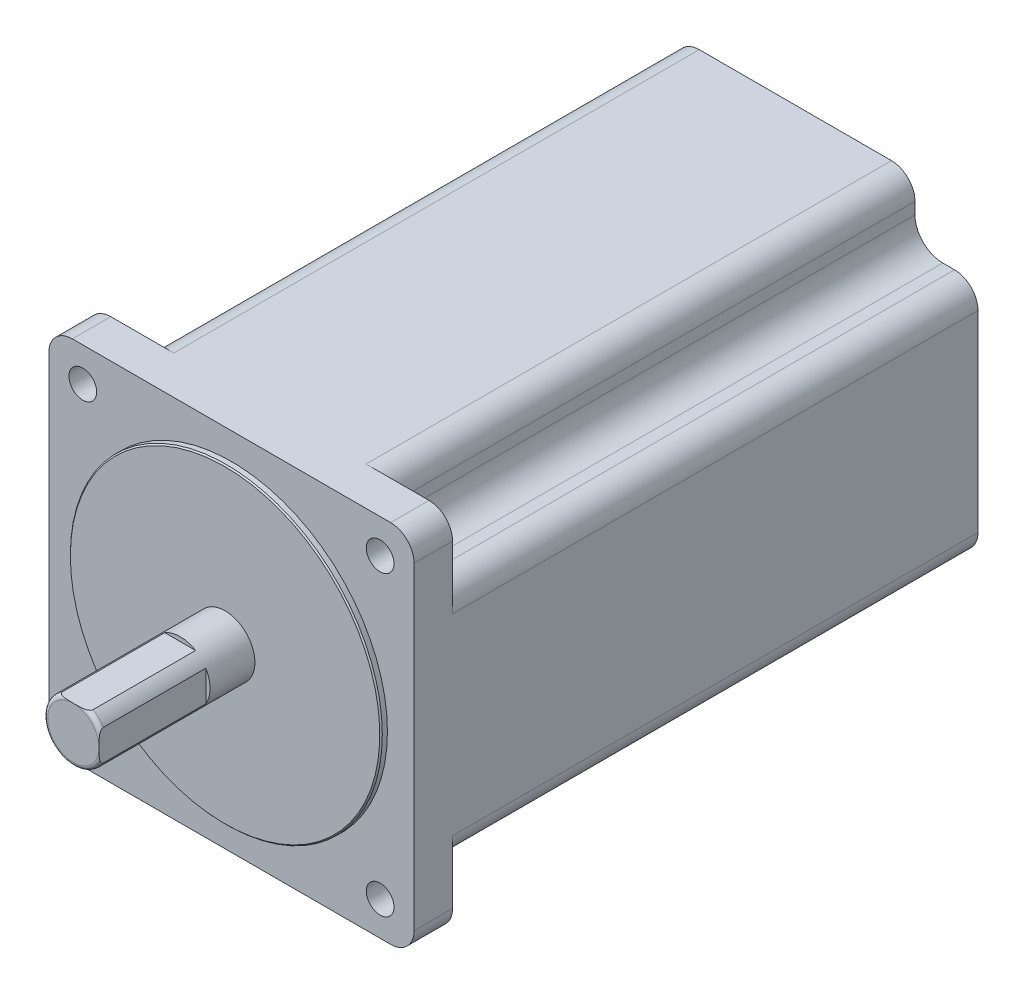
ISO-10303-21;
HEADER;
FILE_DESCRIPTION(('STEP AP214'),'2;1');
FILE_NAME('part.step','',(''),(''),'','','');
FILE_SCHEMA(('AUTOMOTIVE_DESIGN { 1 0 10303 214 1 1 1 1 }'));
ENDSEC;
DATA;
#1=APPLICATION_CONTEXT('core data for automotive mechanical design processes');
#2=APPLICATION_PROTOCOL_DEFINITION('international standard','automotive_design',2000,#1);
#3=PRODUCT_CONTEXT('',#1,'mechanical');
#4=PRODUCT('Part','Part','',(#3));
#5=PRODUCT_RELATED_PRODUCT_CATEGORY('part','',(#4));
#6=PRODUCT_DEFINITION_FORMATION('','',#4);
#7=PRODUCT_DEFINITION_CONTEXT('part definition',#1,'design');
#8=PRODUCT_DEFINITION('design','',#6,#7);
#9=PRODUCT_DEFINITION_SHAPE('','',#8);
#10=(LENGTH_UNIT() NAMED_UNIT(*) SI_UNIT(.MILLI.,.METRE.));
#11=(NAMED_UNIT(*) PLANE_ANGLE_UNIT() SI_UNIT($,.RADIAN.));
#12=(NAMED_UNIT(*) SI_UNIT($,.STERADIAN.) SOLID_ANGLE_UNIT());
#13=UNCERTAINTY_MEASURE_WITH_UNIT(LENGTH_MEASURE(1.E-05),#10,'distance_accuracy_value','');
#14=(GEOMETRIC_REPRESENTATION_CONTEXT(3) GLOBAL_UNCERTAINTY_ASSIGNED_CONTEXT((#13)) GLOBAL_UNIT_ASSIGNED_CONTEXT((#10,
#11,#12)) REPRESENTATION_CONTEXT('',''));
#15=CARTESIAN_POINT('',(0.,0.,0.));
#16=DIRECTION('',(0.,0.,1.));
#17=DIRECTION('',(1.,0.,0.));
#18=AXIS2_PLACEMENT_3D('',#15,#16,#17);
#19=CARTESIAN_POINT('',(0.,0.,35.5));
#20=DIRECTION('',(0.,0.,-1.));
#21=DIRECTION('',(-1.,0.,0.));
#22=AXIS2_PLACEMENT_3D('',#19,#20,#21);
#23=CYLINDRICAL_SURFACE('',#22,7.);
#24=CARTESIAN_POINT('',(0.,0.,0.));
#25=DIRECTION('',(0.,0.,-1.));
#26=DIRECTION('',(-1.,0.,0.));
#27=AXIS2_PLACEMENT_3D('',#24,#25,#26);
#28=CIRCLE('',#27,7.);
#29=CARTESIAN_POINT('',(-7.,0.,0.));
#30=VERTEX_POINT('',#29);
#31=EDGE_CURVE('E867',#30,#30,#28,.T.);
#32=ORIENTED_EDGE('',*,*,#31,.F.);
#33=EDGE_LOOP('',(#32));
#34=FACE_BOUND('',#33,.T.);
#35=CARTESIAN_POINT('',(0.,0.,34.5));
#36=DIRECTION('',(0.,0.,1.));
#37=DIRECTION('',(1.,0.,0.));
#38=AXIS2_PLACEMENT_3D('',#35,#36,#37);
#39=CIRCLE('',#38,7.);
#40=CARTESIAN_POINT('',(6.,-3.60555127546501,34.4999999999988));
#41=VERTEX_POINT('',#40);
#42=CARTESIAN_POINT('',(-3.60555127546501,6.,34.4999999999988));
#43=VERTEX_POINT('',#42);
#44=EDGE_CURVE('E328',#41,#43,#39,.F.);
#45=ORIENTED_EDGE('',*,*,#44,.T.);
#46=DIRECTION('',(0.,0.,-1.));
#47=VECTOR('',#46,1.);
#48=CARTESIAN_POINT('',(-3.60555127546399,6.,35.5));
#49=LINE('',#48,#47);
#50=CARTESIAN_POINT('',(-3.60555127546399,6.,10.5));
#51=VERTEX_POINT('',#50);
#52=EDGE_CURVE('E1401',#43,#51,#49,.T.);
#53=ORIENTED_EDGE('',*,*,#52,.T.);
#54=CARTESIAN_POINT('',(0.,0.,10.5));
#55=DIRECTION('',(0.,0.,1.));
#56=DIRECTION('',(1.,0.,0.));
#57=AXIS2_PLACEMENT_3D('',#54,#55,#56);
#58=CIRCLE('',#57,7.);
#59=CARTESIAN_POINT('',(3.60555127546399,6.,10.5));
#60=VERTEX_POINT('',#59);
#61=EDGE_CURVE('E1425',#60,#51,#58,.T.);
#62=ORIENTED_EDGE('',*,*,#61,.F.);
#63=DIRECTION('',(0.,0.,-1.));
#64=VECTOR('',#63,1.);
#65=CARTESIAN_POINT('',(3.60555127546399,6.,35.5));
#66=LINE('',#65,#64);
#67=CARTESIAN_POINT('',(3.60555127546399,6.,34.5));
#68=VERTEX_POINT('',#67);
#69=EDGE_CURVE('E1398',#60,#68,#66,.F.);
#70=ORIENTED_EDGE('',*,*,#69,.T.);
#71=CARTESIAN_POINT('',(6.,3.60555127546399,34.5));
#72=VERTEX_POINT('',#71);
#73=EDGE_CURVE('E345',#68,#72,#39,.F.);
#74=ORIENTED_EDGE('',*,*,#73,.T.);
#75=DIRECTION('',(0.,0.,-1.));
#76=VECTOR('',#75,1.);
#77=CARTESIAN_POINT('',(6.,3.60555127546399,35.5));
#78=LINE('',#77,#76);
#79=CARTESIAN_POINT('',(6.,3.60555127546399,10.5));
#80=VERTEX_POINT('',#79);
#81=EDGE_CURVE('E63',#80,#72,#78,.F.);
#82=ORIENTED_EDGE('',*,*,#81,.F.);
#83=CARTESIAN_POINT('',(6.,-3.60555127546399,10.5));
#84=VERTEX_POINT('',#83);
#85=EDGE_CURVE('E1427',#84,#80,#58,.T.);
#86=ORIENTED_EDGE('',*,*,#85,.F.);
#87=DIRECTION('',(0.,0.,-1.));
#88=VECTOR('',#87,1.);
#89=CARTESIAN_POINT('',(6.,-3.60555127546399,35.5));
#90=LINE('',#89,#88);
#91=EDGE_CURVE('E1396',#41,#84,#90,.T.);
#92=ORIENTED_EDGE('',*,*,#91,.F.);
#93=EDGE_LOOP('',(#45,#53,#62,#70,#74,#82,#86,#92));
#94=FACE_BOUND('',#93,.T.);
#95=ADVANCED_FACE('F40',(#34,#94),#23,.T.);
#96=CARTESIAN_POINT('',(0.,0.,34.5));
#97=DIRECTION('',(0.,0.,1.));
#98=DIRECTION('',(1.,0.,0.));
#99=AXIS2_PLACEMENT_3D('',#96,#97,#98);
#100=TOROIDAL_SURFACE('',#99,6.,1.);
#101=CARTESIAN_POINT('',(-3.60310285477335,6.,34.4498));
#102=CARTESIAN_POINT('',(-3.60606903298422,6.,34.4794230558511));
#103=CARTESIAN_POINT('',(-3.60634334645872,6.,34.5092692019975));
#104=CARTESIAN_POINT('',(-3.60183180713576,6.,34.5683743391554));
#105=CARTESIAN_POINT('',(-3.5970811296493,6.,34.5976359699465));
#106=CARTESIAN_POINT('',(-3.58288474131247,6.,34.6549369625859));
#107=CARTESIAN_POINT('',(-3.57344503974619,6.,34.6829778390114));
#108=CARTESIAN_POINT('',(-3.55053706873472,6.,34.7373798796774));
#109=CARTESIAN_POINT('',(-3.53706251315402,6.,34.7637383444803));
#110=CARTESIAN_POINT('',(-3.49911909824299,6.,34.8273406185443));
#111=CARTESIAN_POINT('',(-3.47254030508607,6.,34.8633245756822));
#112=CARTESIAN_POINT('',(-3.41403959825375,6.,34.930664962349));
#113=CARTESIAN_POINT('',(-3.38210229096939,6.,34.9620075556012));
#114=CARTESIAN_POINT('',(-3.29347227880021,6.,35.0386085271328));
#115=CARTESIAN_POINT('',(-3.23376530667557,6.,35.0803505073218));
#116=CARTESIAN_POINT('',(-3.10904816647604,6.,35.1545976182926));
#117=CARTESIAN_POINT('',(-3.04403268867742,6.,35.18709335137));
#118=CARTESIAN_POINT('',(-2.91093070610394,6.,35.2447829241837));
#119=CARTESIAN_POINT('',(-2.84284537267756,6.,35.269979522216));
#120=CARTESIAN_POINT('',(-2.70477563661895,6.,35.3145991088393));
#121=CARTESIAN_POINT('',(-2.6347892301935,6.,35.3340157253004));
#122=CARTESIAN_POINT('',(-2.4933113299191,6.,35.3683088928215));
#123=CARTESIAN_POINT('',(-2.42181350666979,6.,35.3831587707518));
#124=CARTESIAN_POINT('',(-2.27821414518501,6.,35.4090924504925));
#125=CARTESIAN_POINT('',(-2.20611314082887,6.,35.4201792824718));
#126=CARTESIAN_POINT('',(-2.0472037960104,6.,35.4412630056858));
#127=CARTESIAN_POINT('',(-1.96031085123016,6.,35.4506091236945));
#128=CARTESIAN_POINT('',(-1.78623141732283,6.,35.4660708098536));
#129=CARTESIAN_POINT('',(-1.69904486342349,6.,35.4721856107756));
#130=CARTESIAN_POINT('',(-1.52445988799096,6.,35.4820458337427));
#131=CARTESIAN_POINT('',(-1.43706134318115,6.,35.4857889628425));
#132=CARTESIAN_POINT('',(-1.26220665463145,6.,35.4916073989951));
#133=CARTESIAN_POINT('',(-1.17475050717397,6.,35.4936825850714));
#134=CARTESIAN_POINT('',(-0.999487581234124,6.,35.4967511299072));
#135=CARTESIAN_POINT('',(-0.911680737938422,6.,35.4977403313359));
#136=CARTESIAN_POINT('',(-0.736061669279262,6.,35.4990875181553));
#137=CARTESIAN_POINT('',(-0.648249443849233,6.,35.4994454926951));
#138=CARTESIAN_POINT('',(-0.472684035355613,6.,35.4998721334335));
#139=CARTESIAN_POINT('',(-0.384930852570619,6.,35.4999409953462));
#140=CARTESIAN_POINT('',(-0.209424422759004,6.,35.5000049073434));
#141=CARTESIAN_POINT('',(-0.121671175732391,6.,35.4999999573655));
#142=CARTESIAN_POINT('',(0.0534958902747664,6.,35.5000000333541));
#143=CARTESIAN_POINT('',(0.140909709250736,6.,35.5000050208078));
#144=CARTESIAN_POINT('',(0.31573730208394,6.,35.4999761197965));
#145=CARTESIAN_POINT('',(0.40315107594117,6.,35.499942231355));
#146=CARTESIAN_POINT('',(0.578031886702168,6.,35.4996567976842));
#147=CARTESIAN_POINT('',(0.66549892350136,6.,35.4994051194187));
#148=CARTESIAN_POINT('',(0.840429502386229,6.,35.4983788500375));
#149=CARTESIAN_POINT('',(0.927893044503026,6.,35.4976042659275));
#150=CARTESIAN_POINT('',(1.10251222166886,6.,35.4951097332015));
#151=CARTESIAN_POINT('',(1.18966789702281,6.,35.4933929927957));
#152=CARTESIAN_POINT('',(1.36393564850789,6.,35.4884754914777));
#153=CARTESIAN_POINT('',(1.4510477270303,6.,35.4852748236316));
#154=CARTESIAN_POINT('',(1.62510052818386,6.,35.4767270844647));
#155=CARTESIAN_POINT('',(1.71204133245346,6.,35.471381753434));
#156=CARTESIAN_POINT('',(1.8856863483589,6.,35.4577415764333));
#157=CARTESIAN_POINT('',(1.97239060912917,6.,35.4494473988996));
#158=CARTESIAN_POINT('',(2.10407408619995,6.,35.433817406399));
#159=CARTESIAN_POINT('',(2.14922335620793,6.,35.4279124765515));
#160=CARTESIAN_POINT('',(2.23935687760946,6.,35.4148544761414));
#161=CARTESIAN_POINT('',(2.28434107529,6.,35.4077010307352));
#162=CARTESIAN_POINT('',(2.37424904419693,6.,35.3919272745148));
#163=CARTESIAN_POINT('',(2.41917176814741,6.,35.3833009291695));
#164=CARTESIAN_POINT('',(2.50866395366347,6.,35.3643855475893));
#165=CARTESIAN_POINT('',(2.55323343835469,6.,35.3540966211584));
#166=CARTESIAN_POINT('',(2.65933979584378,6.,35.3271831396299));
#167=CARTESIAN_POINT('',(2.72065381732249,6.,35.309658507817));
#168=CARTESIAN_POINT('',(2.84189365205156,6.,35.2700713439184));
#169=CARTESIAN_POINT('',(2.9018180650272,6.,35.2480044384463));
#170=CARTESIAN_POINT('',(3.01892944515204,6.,35.1985144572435));
#171=CARTESIAN_POINT('',(3.07613337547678,6.,35.171132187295));
#172=CARTESIAN_POINT('',(3.1867963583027,6.,35.1097235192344));
#173=CARTESIAN_POINT('',(3.2402649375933,6.,35.0757149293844));
#174=CARTESIAN_POINT('',(3.32212583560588,6.,35.0139772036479));
#175=CARTESIAN_POINT('',(3.35237087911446,6.,34.988716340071));
#176=CARTESIAN_POINT('',(3.4096487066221,6.,34.9346946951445));
#177=CARTESIAN_POINT('',(3.43667963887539,6.,34.905931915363));
#178=CARTESIAN_POINT('',(3.48654628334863,6.,34.8443922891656));
#179=CARTESIAN_POINT('',(3.50933353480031,6.,34.8115754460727));
#180=CARTESIAN_POINT('',(3.54866231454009,6.,34.7423666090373));
#181=CARTESIAN_POINT('',(3.56521573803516,6.,34.7059815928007));
#182=CARTESIAN_POINT('',(3.58720258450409,6.,34.6400371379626));
#183=CARTESIAN_POINT('',(3.59438512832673,6.,34.6110603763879));
#184=CARTESIAN_POINT('',(3.60372793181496,6.,34.5523411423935));
#185=CARTESIAN_POINT('',(3.60589903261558,6.,34.5226004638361));
#186=CARTESIAN_POINT('',(3.60531020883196,6.,34.478514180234));
#187=CARTESIAN_POINT('',(3.60451304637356,6.,34.464123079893));
#188=CARTESIAN_POINT('',(3.60310285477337,6.,34.4498000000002));
#189=B_SPLINE_CURVE_WITH_KNOTS('',3,(#101,#102,#103,#104,#105,#106,#107,#108,#109,#110,#111,
#112,#113,#114,#115,#116,#117,#118,#119,#120,#121,#122,#123,#124,#125,#126,#127,#128,#129,#130,
#131,#132,#133,#134,#135,#136,#137,#138,#139,#140,#141,#142,#143,#144,#145,#146,#147,#148,#149,
#150,#151,#152,#153,#154,#155,#156,#157,#158,#159,#160,#161,#162,#163,#164,#165,#166,#167,#168,
#169,#170,#171,#172,#173,#174,#175,#176,#177,#178,#179,#180,#181,#182,#183,#184,#185,#186,#187,
#188),.UNSPECIFIED.,.F.,.F.,(4,2,2,2,2,2,2,2,2,2,2,2,2,2,2,2,2,2,2,2,2,2,2,2,2,2,2,2,2,2,2,2,2,
2,2,2,2,2,2,2,2,2,2,4),(0.,0.0891302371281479,0.177640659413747,0.266037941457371,
0.354573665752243,0.488015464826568,0.621847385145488,0.839168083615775,1.05670887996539,
1.27416736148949,1.49186469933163,1.71081040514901,1.92957938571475,2.19167726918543,
2.45383735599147,2.71625051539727,2.97868270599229,3.24211606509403,3.50555395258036,
3.76881347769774,4.03207322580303,4.29431468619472,4.55655598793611,4.8189575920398,
5.08135568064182,5.34286575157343,5.60435942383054,5.86564133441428,6.1268640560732,
6.26345130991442,6.40007964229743,6.5372818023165,6.67447490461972,6.86564045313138,
7.05699092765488,7.24692669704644,7.43635888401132,7.55435538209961,7.67241953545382,
7.79175876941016,7.91086911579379,8.00004527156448,8.08902833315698,8.13221435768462),.UNSPECIFIED.);
#190=CARTESIAN_POINT('',(0.,6.,35.5));
#191=VERTEX_POINT('',#190);
#192=EDGE_CURVE('E55',#43,#191,#189,.T.);
#193=ORIENTED_EDGE('',*,*,#192,.F.);
#194=ORIENTED_EDGE('',*,*,#44,.F.);
#195=CARTESIAN_POINT('',(6.,-3.60310285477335,34.4498));
#196=CARTESIAN_POINT('',(6.,-3.60606903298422,34.4794230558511));
#197=CARTESIAN_POINT('',(6.,-3.60634334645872,34.5092692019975));
#198=CARTESIAN_POINT('',(6.,-3.60183180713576,34.5683743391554));
#199=CARTESIAN_POINT('',(6.,-3.5970811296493,34.5976359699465));
#200=CARTESIAN_POINT('',(6.,-3.58288474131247,34.6549369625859));
#201=CARTESIAN_POINT('',(6.,-3.57344503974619,34.6829778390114));
#202=CARTESIAN_POINT('',(6.,-3.55053706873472,34.7373798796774));
#203=CARTESIAN_POINT('',(6.,-3.53706251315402,34.7637383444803));
#204=CARTESIAN_POINT('',(6.,-3.49911909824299,34.8273406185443));
#205=CARTESIAN_POINT('',(6.,-3.47254030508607,34.8633245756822));
#206=CARTESIAN_POINT('',(6.,-3.41403959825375,34.930664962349));
#207=CARTESIAN_POINT('',(6.,-3.38210229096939,34.9620075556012));
#208=CARTESIAN_POINT('',(6.,-3.29347227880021,35.0386085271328));
#209=CARTESIAN_POINT('',(6.,-3.23376530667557,35.0803505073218));
#210=CARTESIAN_POINT('',(6.,-3.10904816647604,35.1545976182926));
#211=CARTESIAN_POINT('',(6.,-3.04403268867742,35.18709335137));
#212=CARTESIAN_POINT('',(6.,-2.91093070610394,35.2447829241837));
#213=CARTESIAN_POINT('',(6.,-2.84284537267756,35.269979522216));
#214=CARTESIAN_POINT('',(6.,-2.70477563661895,35.3145991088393));
#215=CARTESIAN_POINT('',(6.,-2.6347892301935,35.3340157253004));
#216=CARTESIAN_POINT('',(6.,-2.4933113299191,35.3683088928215));
#217=CARTESIAN_POINT('',(6.,-2.42181350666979,35.3831587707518));
#218=CARTESIAN_POINT('',(6.,-2.27821414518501,35.4090924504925));
#219=CARTESIAN_POINT('',(6.,-2.20611314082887,35.4201792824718));
#220=CARTESIAN_POINT('',(6.,-2.0472037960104,35.4412630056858));
#221=CARTESIAN_POINT('',(6.,-1.96031085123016,35.4506091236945));
#222=CARTESIAN_POINT('',(6.,-1.78623141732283,35.4660708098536));
#223=CARTESIAN_POINT('',(6.,-1.69904486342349,35.4721856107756));
#224=CARTESIAN_POINT('',(6.,-1.52445988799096,35.4820458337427));
#225=CARTESIAN_POINT('',(6.,-1.43706134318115,35.4857889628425));
#226=CARTESIAN_POINT('',(6.,-1.26220665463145,35.4916073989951));
#227=CARTESIAN_POINT('',(6.,-1.17475050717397,35.4936825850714));
#228=CARTESIAN_POINT('',(6.,-0.999487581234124,35.4967511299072));
#229=CARTESIAN_POINT('',(6.,-0.911680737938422,35.4977403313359));
#230=CARTESIAN_POINT('',(6.,-0.736061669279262,35.4990875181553));
#231=CARTESIAN_POINT('',(6.,-0.648249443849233,35.4994454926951));
#232=CARTESIAN_POINT('',(6.,-0.472684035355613,35.4998721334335));
#233=CARTESIAN_POINT('',(6.,-0.384930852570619,35.4999409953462));
#234=CARTESIAN_POINT('',(6.,-0.209424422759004,35.5000049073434));
#235=CARTESIAN_POINT('',(6.,-0.121671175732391,35.4999999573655));
#236=CARTESIAN_POINT('',(6.,0.0534958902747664,35.5000000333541));
#237=CARTESIAN_POINT('',(6.,0.140909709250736,35.5000050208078));
#238=CARTESIAN_POINT('',(6.,0.31573730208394,35.4999761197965));
#239=CARTESIAN_POINT('',(6.,0.40315107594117,35.499942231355));
#240=CARTESIAN_POINT('',(6.,0.578031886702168,35.4996567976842));
#241=CARTESIAN_POINT('',(6.,0.66549892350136,35.4994051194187));
#242=CARTESIAN_POINT('',(6.,0.840429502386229,35.4983788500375));
#243=CARTESIAN_POINT('',(6.,0.927893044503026,35.4976042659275));
#244=CARTESIAN_POINT('',(6.,1.10251222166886,35.4951097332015));
#245=CARTESIAN_POINT('',(6.,1.18966789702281,35.4933929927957));
#246=CARTESIAN_POINT('',(6.,1.36393564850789,35.4884754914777));
#247=CARTESIAN_POINT('',(6.,1.4510477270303,35.4852748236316));
#248=CARTESIAN_POINT('',(6.,1.62510052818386,35.4767270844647));
#249=CARTESIAN_POINT('',(6.,1.71204133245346,35.471381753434));
#250=CARTESIAN_POINT('',(6.,1.8856863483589,35.4577415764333));
#251=CARTESIAN_POINT('',(6.,1.97239060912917,35.4494473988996));
#252=CARTESIAN_POINT('',(6.,2.10407408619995,35.433817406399));
#253=CARTESIAN_POINT('',(6.,2.14922335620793,35.4279124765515));
#254=CARTESIAN_POINT('',(6.,2.23935687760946,35.4148544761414));
#255=CARTESIAN_POINT('',(6.,2.28434107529,35.4077010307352));
#256=CARTESIAN_POINT('',(6.,2.37424904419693,35.3919272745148));
#257=CARTESIAN_POINT('',(6.,2.41917176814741,35.3833009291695));
#258=CARTESIAN_POINT('',(6.,2.50866395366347,35.3643855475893));
#259=CARTESIAN_POINT('',(6.,2.55323343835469,35.3540966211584));
#260=CARTESIAN_POINT('',(6.,2.65933979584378,35.3271831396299));
#261=CARTESIAN_POINT('',(6.,2.72065381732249,35.309658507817));
#262=CARTESIAN_POINT('',(6.,2.84189365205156,35.2700713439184));
#263=CARTESIAN_POINT('',(6.,2.9018180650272,35.2480044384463));
#264=CARTESIAN_POINT('',(6.,3.01892944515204,35.1985144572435));
#265=CARTESIAN_POINT('',(6.,3.07613337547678,35.171132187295));
#266=CARTESIAN_POINT('',(6.,3.1867963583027,35.1097235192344));
#267=CARTESIAN_POINT('',(6.,3.2402649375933,35.0757149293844));
#268=CARTESIAN_POINT('',(6.,3.32212583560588,35.0139772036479));
#269=CARTESIAN_POINT('',(6.,3.35237087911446,34.988716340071));
#270=CARTESIAN_POINT('',(6.,3.4096487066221,34.9346946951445));
#271=CARTESIAN_POINT('',(6.,3.43667963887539,34.905931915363));
#272=CARTESIAN_POINT('',(6.,3.48654628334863,34.8443922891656));
#273=CARTESIAN_POINT('',(6.,3.50933353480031,34.8115754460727));
#274=CARTESIAN_POINT('',(6.,3.54866231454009,34.7423666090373));
#275=CARTESIAN_POINT('',(6.,3.56521573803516,34.7059815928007));
#276=CARTESIAN_POINT('',(6.,3.58720258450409,34.6400371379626));
#277=CARTESIAN_POINT('',(6.,3.59438512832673,34.6110603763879));
#278=CARTESIAN_POINT('',(6.,3.60372793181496,34.5523411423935));
#279=CARTESIAN_POINT('',(6.,3.60589903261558,34.5226004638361));
#280=CARTESIAN_POINT('',(6.,3.60531020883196,34.478514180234));
#281=CARTESIAN_POINT('',(6.,3.60451304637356,34.464123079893));
#282=CARTESIAN_POINT('',(6.,3.60310285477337,34.4498000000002));
#283=B_SPLINE_CURVE_WITH_KNOTS('',3,(#195,#196,#197,#198,#199,#200,#201,#202,#203,#204,#205,
#206,#207,#208,#209,#210,#211,#212,#213,#214,#215,#216,#217,#218,#219,#220,#221,#222,#223,#224,
#225,#226,#227,#228,#229,#230,#231,#232,#233,#234,#235,#236,#237,#238,#239,#240,#241,#242,#243,
#244,#245,#246,#247,#248,#249,#250,#251,#252,#253,#254,#255,#256,#257,#258,#259,#260,#261,#262,
#263,#264,#265,#266,#267,#268,#269,#270,#271,#272,#273,#274,#275,#276,#277,#278,#279,#280,#281,
#282),.UNSPECIFIED.,.F.,.F.,(4,2,2,2,2,2,2,2,2,2,2,2,2,2,2,2,2,2,2,2,2,2,2,2,2,2,2,2,2,2,2,2,2,
2,2,2,2,2,2,2,2,2,2,4),(0.,0.0891302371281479,0.177640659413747,0.266037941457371,
0.354573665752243,0.488015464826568,0.621847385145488,0.839168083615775,1.05670887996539,
1.27416736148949,1.49186469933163,1.71081040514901,1.92957938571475,2.19167726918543,
2.45383735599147,2.71625051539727,2.97868270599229,3.24211606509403,3.50555395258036,
3.76881347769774,4.03207322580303,4.29431468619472,4.55655598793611,4.8189575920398,
5.08135568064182,5.34286575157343,5.60435942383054,5.86564133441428,6.1268640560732,
6.26345130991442,6.40007964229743,6.5372818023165,6.67447490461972,6.86564045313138,
7.05699092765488,7.24692669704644,7.43635888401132,7.55435538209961,7.67241953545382,
7.79175876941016,7.91086911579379,8.00004527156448,8.08902833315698,8.13221435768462),.UNSPECIFIED.);
#284=CARTESIAN_POINT('',(6.,-4.63767449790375E-07,35.5));
#285=VERTEX_POINT('',#284);
#286=EDGE_CURVE('E322',#41,#285,#283,.T.);
#287=ORIENTED_EDGE('',*,*,#286,.T.);
#288=CARTESIAN_POINT('',(0.,0.,35.5));
#289=DIRECTION('',(0.,0.,1.));
#290=DIRECTION('',(1.,0.,0.));
#291=AXIS2_PLACEMENT_3D('',#288,#289,#290);
#292=CIRCLE('',#291,6.);
#293=EDGE_CURVE('E335',#191,#285,#292,.T.);
#294=ORIENTED_EDGE('',*,*,#293,.F.);
#295=EDGE_LOOP('',(#193,#194,#287,#294));
#296=FACE_BOUND('',#295,.T.);
#297=ADVANCED_FACE('F334',(#296),#100,.T.);
#298=EDGE_CURVE('E338',#191,#68,#189,.T.);
#299=ORIENTED_EDGE('',*,*,#298,.F.);
#300=EDGE_CURVE('E341',#285,#191,#292,.T.);
#301=ORIENTED_EDGE('',*,*,#300,.F.);
#302=EDGE_CURVE('E319',#285,#72,#283,.T.);
#303=ORIENTED_EDGE('',*,*,#302,.T.);
#304=ORIENTED_EDGE('',*,*,#73,.F.);
#305=EDGE_LOOP('',(#299,#301,#303,#304));
#306=FACE_BOUND('',#305,.T.);
#307=ADVANCED_FACE('F344',(#306),#100,.T.);
#308=CARTESIAN_POINT('',(13.25,-54.75,-133.5));
#309=DIRECTION('',(-1.,0.,0.));
#310=DIRECTION('',(0.,0.,1.));
#311=AXIS2_PLACEMENT_3D('',#308,#309,#310);
#312=PLANE('',#311);
#313=DIRECTION('',(0.,0.,1.));
#314=VECTOR('',#313,1.);
#315=CARTESIAN_POINT('',(13.25,-49.75,-133.5));
#316=LINE('',#315,#314);
#317=CARTESIAN_POINT('',(13.25,-49.75,-131.042857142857));
#318=VERTEX_POINT('',#317);
#319=CARTESIAN_POINT('',(13.25,-49.75,-112.5));
#320=VERTEX_POINT('',#319);
#321=EDGE_CURVE('E659',#318,#320,#316,.T.);
#322=ORIENTED_EDGE('',*,*,#321,.F.);
#323=DIRECTION('',(0.,0.631271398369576,-0.775562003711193));
#324=VECTOR('',#323,1.);
#325=CARTESIAN_POINT('',(13.25,-50.5395250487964,-130.072869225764));
#326=LINE('',#325,#324);
#327=CARTESIAN_POINT('',(13.25,-47.75,-133.5));
#328=VERTEX_POINT('',#327);
#329=EDGE_CURVE('E665',#318,#328,#326,.T.);
#330=ORIENTED_EDGE('',*,*,#329,.T.);
#331=DIRECTION('',(0.,1.,0.));
#332=VECTOR('',#331,1.);
#333=CARTESIAN_POINT('',(13.25,-54.75,-133.5));
#334=LINE('',#333,#332);
#335=CARTESIAN_POINT('',(13.25,-42.75,-133.5));
#336=VERTEX_POINT('',#335);
#337=EDGE_CURVE('E694',#328,#336,#334,.T.);
#338=ORIENTED_EDGE('',*,*,#337,.T.);
#339=DIRECTION('',(0.,0.,1.));
#340=VECTOR('',#339,1.);
#341=CARTESIAN_POINT('',(13.25,-42.75,-133.5));
#342=LINE('',#341,#340);
#343=CARTESIAN_POINT('',(13.25,-42.75,-112.5));
#344=VERTEX_POINT('',#343);
#345=EDGE_CURVE('E688',#336,#344,#342,.T.);
#346=ORIENTED_EDGE('',*,*,#345,.T.);
#347=DIRECTION('',(0.,1.,0.));
#348=VECTOR('',#347,1.);
#349=CARTESIAN_POINT('',(13.25,-54.75,-112.5));
#350=LINE('',#349,#348);
#351=EDGE_CURVE('E668',#320,#344,#350,.T.);
#352=ORIENTED_EDGE('',*,*,#351,.F.);
#353=EDGE_LOOP('',(#322,#330,#338,#346,#352));
#354=FACE_BOUND('',#353,.T.);
#355=ADVANCED_FACE('F390',(#354),#312,.F.);
#356=CARTESIAN_POINT('',(-13.25,-54.75,-112.5));
#357=DIRECTION('',(0.,0.,-1.));
#358=DIRECTION('',(-1.,0.,0.));
#359=AXIS2_PLACEMENT_3D('',#356,#357,#358);
#360=PLANE('',#359);
#361=DIRECTION('',(0.754605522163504,0.656178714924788,0.));
#362=VECTOR('',#361,1.);
#363=CARTESIAN_POINT('',(30.3390742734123,-34.8899354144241,-112.5));
#364=LINE('',#363,#362);
#365=CARTESIAN_POINT('',(7.50000000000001,-54.75,-112.5));
#366=VERTEX_POINT('',#365);
#367=EDGE_CURVE('E1404',#366,#320,#364,.T.);
#368=ORIENTED_EDGE('',*,*,#367,.T.);
#369=ORIENTED_EDGE('',*,*,#351,.T.);
#370=DIRECTION('',(-1.,0.,0.));
#371=VECTOR('',#370,1.);
#372=CARTESIAN_POINT('',(-13.25,-42.75,-112.5));
#373=LINE('',#372,#371);
#374=CARTESIAN_POINT('',(-13.25,-42.75,-112.5));
#375=VERTEX_POINT('',#374);
#376=EDGE_CURVE('E685',#344,#375,#373,.T.);
#377=ORIENTED_EDGE('',*,*,#376,.T.);
#378=DIRECTION('',(0.,1.,0.));
#379=VECTOR('',#378,1.);
#380=CARTESIAN_POINT('',(-13.25,-54.75,-112.5));
#381=LINE('',#380,#379);
#382=CARTESIAN_POINT('',(-13.25,-49.75,-112.5));
#383=VERTEX_POINT('',#382);
#384=EDGE_CURVE('E684',#383,#375,#381,.T.);
#385=ORIENTED_EDGE('',*,*,#384,.F.);
#386=DIRECTION('',(-0.754605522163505,0.656178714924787,0.));
#387=VECTOR('',#386,1.);
#388=CARTESIAN_POINT('',(-30.3390742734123,-34.8899354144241,-112.5));
#389=LINE('',#388,#387);
#390=CARTESIAN_POINT('',(-7.49999999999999,-54.75,-112.5));
#391=VERTEX_POINT('',#390);
#392=EDGE_CURVE('E669',#391,#383,#389,.T.);
#393=ORIENTED_EDGE('',*,*,#392,.F.);
#394=DIRECTION('',(-1.,0.,0.));
#395=VECTOR('',#394,1.);
#396=CARTESIAN_POINT('',(-13.25,-54.75,-112.5));
#397=LINE('',#396,#395);
#398=EDGE_CURVE('E682',#366,#391,#397,.T.);
#399=ORIENTED_EDGE('',*,*,#398,.F.);
#400=EDGE_LOOP('',(#368,#369,#377,#385,#393,#399));
#401=FACE_BOUND('',#400,.T.);
#402=ADVANCED_FACE('F386',(#401),#360,.F.);
#403=CARTESIAN_POINT('',(0.,-54.75,0.));
#404=DIRECTION('',(0.,1.,0.));
#405=DIRECTION('',(0.,0.,1.));
#406=AXIS2_PLACEMENT_3D('',#403,#404,#405);
#407=PLANE('',#406);
#408=DIRECTION('',(0.,0.,1.));
#409=VECTOR('',#408,1.);
#410=CARTESIAN_POINT('',(7.50000000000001,-54.75,-133.5));
#411=LINE('',#410,#409);
#412=CARTESIAN_POINT('',(7.50000000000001,-54.75,-124.9));
#413=VERTEX_POINT('',#412);
#414=EDGE_CURVE('E662',#413,#366,#411,.T.);
#415=ORIENTED_EDGE('',*,*,#414,.T.);
#416=ORIENTED_EDGE('',*,*,#398,.T.);
#417=DIRECTION('',(0.,0.,1.));
#418=VECTOR('',#417,1.);
#419=CARTESIAN_POINT('',(-7.49999999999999,-54.75,-133.5));
#420=LINE('',#419,#418);
#421=CARTESIAN_POINT('',(-7.5,-54.75,-124.9));
#422=VERTEX_POINT('',#421);
#423=EDGE_CURVE('E1408',#422,#391,#420,.T.);
#424=ORIENTED_EDGE('',*,*,#423,.F.);
#425=DIRECTION('',(1.,0.,0.));
#426=VECTOR('',#425,1.);
#427=CARTESIAN_POINT('',(0.,-54.75,-124.9));
#428=LINE('',#427,#426);
#429=EDGE_CURVE('E651',#422,#413,#428,.T.);
#430=ORIENTED_EDGE('',*,*,#429,.T.);
#431=EDGE_LOOP('',(#415,#416,#424,#430));
#432=FACE_BOUND('',#431,.T.);
#433=ADVANCED_FACE('F382',(#432),#407,.F.);
#434=CARTESIAN_POINT('',(-42.75,-47.75,-133.5));
#435=DIRECTION('',(0.,0.775562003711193,0.631271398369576));
#436=DIRECTION('',(0.,-0.631271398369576,0.775562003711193));
#437=AXIS2_PLACEMENT_3D('',#434,#435,#436);
#438=PLANE('',#437);
#439=DIRECTION('',(0.587477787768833,0.510850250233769,-0.627616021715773));
#440=VECTOR('',#439,1.);
#441=CARTESIAN_POINT('',(-4.57108781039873,-65.2465980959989,-112.004179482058));
#442=LINE('',#441,#440);
#443=EDGE_CURVE('E342',#413,#318,#442,.T.);
#444=ORIENTED_EDGE('',*,*,#443,.F.);
#445=ORIENTED_EDGE('',*,*,#429,.F.);
#446=DIRECTION('',(-0.587477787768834,0.510850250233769,-0.627616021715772));
#447=VECTOR('',#446,1.);
#448=CARTESIAN_POINT('',(-24.937540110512,-39.5869216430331,-143.528924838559));
#449=LINE('',#448,#447);
#450=CARTESIAN_POINT('',(-13.25,-49.75,-131.042857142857));
#451=VERTEX_POINT('',#450);
#452=EDGE_CURVE('E653',#422,#451,#449,.T.);
#453=ORIENTED_EDGE('',*,*,#452,.T.);
#454=DIRECTION('',(0.,-0.631271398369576,0.775562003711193));
#455=VECTOR('',#454,1.);
#456=CARTESIAN_POINT('',(-13.25,-50.5395250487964,-130.072869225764));
#457=LINE('',#456,#455);
#458=CARTESIAN_POINT('',(-13.25,-47.75,-133.5));
#459=VERTEX_POINT('',#458);
#460=EDGE_CURVE('E674',#459,#451,#457,.T.);
#461=ORIENTED_EDGE('',*,*,#460,.F.);
#462=DIRECTION('',(1.,0.,0.));
#463=VECTOR('',#462,1.);
#464=CARTESIAN_POINT('',(-42.75,-47.75,-133.5));
#465=LINE('',#464,#463);
#466=EDGE_CURVE('E672',#459,#328,#465,.T.);
#467=ORIENTED_EDGE('',*,*,#466,.T.);
#468=ORIENTED_EDGE('',*,*,#329,.F.);
#469=EDGE_LOOP('',(#444,#445,#453,#461,#467,#468));
#470=FACE_BOUND('',#469,.T.);
#471=ADVANCED_FACE('F378',(#470),#438,.F.);
#472=CARTESIAN_POINT('',(42.75,-42.75,-10.5));
#473=DIRECTION('',(0.,1.,0.));
#474=DIRECTION('',(0.,0.,1.));
#475=AXIS2_PLACEMENT_3D('',#472,#473,#474);
#476=PLANE('',#475);
#477=DIRECTION('',(0.,0.,-1.));
#478=VECTOR('',#477,1.);
#479=CARTESIAN_POINT('',(-13.25,-42.75,-133.5));
#480=LINE('',#479,#478);
#481=CARTESIAN_POINT('',(-13.25,-42.75,-133.5));
#482=VERTEX_POINT('',#481);
#483=EDGE_CURVE('E676',#375,#482,#480,.T.);
#484=ORIENTED_EDGE('',*,*,#483,.F.);
#485=ORIENTED_EDGE('',*,*,#376,.F.);
#486=ORIENTED_EDGE('',*,*,#345,.F.);
#487=DIRECTION('',(-1.,0.,0.));
#488=VECTOR('',#487,1.);
#489=CARTESIAN_POINT('',(0.,-42.75,-133.5));
#490=LINE('',#489,#488);
#491=CARTESIAN_POINT('',(22.5,-42.75,-133.5));
#492=VERTEX_POINT('',#491);
#493=EDGE_CURVE('E728',#492,#336,#490,.T.);
#494=ORIENTED_EDGE('',*,*,#493,.F.);
#495=DIRECTION('',(0.,0.,1.));
#496=VECTOR('',#495,1.);
#497=CARTESIAN_POINT('',(22.5,-42.75,-10.5));
#498=LINE('',#497,#496);
#499=CARTESIAN_POINT('',(22.5,-42.75,-10.5));
#500=VERTEX_POINT('',#499);
#501=EDGE_CURVE('E585',#492,#500,#498,.T.);
#502=ORIENTED_EDGE('',*,*,#501,.T.);
#503=DIRECTION('',(-1.,0.,0.));
#504=VECTOR('',#503,1.);
#505=CARTESIAN_POINT('',(42.75,-42.75,-10.5));
#506=LINE('',#505,#504);
#507=CARTESIAN_POINT('',(37.25,-42.75,-10.5));
#508=VERTEX_POINT('',#507);
#509=EDGE_CURVE('E844',#508,#500,#506,.T.);
#510=ORIENTED_EDGE('',*,*,#509,.F.);
#511=DIRECTION('',(0.,0.,1.));
#512=VECTOR('',#511,1.);
#513=CARTESIAN_POINT('',(37.25,-42.75,-10.5));
#514=LINE('',#513,#512);
#515=CARTESIAN_POINT('',(37.25,-42.75,-1.5));
#516=VERTEX_POINT('',#515);
#517=EDGE_CURVE('E879',#508,#516,#514,.T.);
#518=ORIENTED_EDGE('',*,*,#517,.T.);
#519=DIRECTION('',(-1.,0.,0.));
#520=VECTOR('',#519,1.);
#521=CARTESIAN_POINT('',(42.75,-42.75,-1.5));
#522=LINE('',#521,#520);
#523=CARTESIAN_POINT('',(-37.25,-42.75,-1.5));
#524=VERTEX_POINT('',#523);
#525=EDGE_CURVE('E875',#516,#524,#522,.T.);
#526=ORIENTED_EDGE('',*,*,#525,.T.);
#527=DIRECTION('',(0.,0.,1.));
#528=VECTOR('',#527,1.);
#529=CARTESIAN_POINT('',(-37.25,-42.75,-10.5));
#530=LINE('',#529,#528);
#531=CARTESIAN_POINT('',(-37.25,-42.75,-10.5));
#532=VERTEX_POINT('',#531);
#533=EDGE_CURVE('E872',#524,#532,#530,.F.);
#534=ORIENTED_EDGE('',*,*,#533,.T.);
#535=CARTESIAN_POINT('',(-22.5,-42.75,-10.5));
#536=VERTEX_POINT('',#535);
#537=EDGE_CURVE('E742',#536,#532,#506,.T.);
#538=ORIENTED_EDGE('',*,*,#537,.F.);
#539=DIRECTION('',(0.,0.,1.));
#540=VECTOR('',#539,1.);
#541=CARTESIAN_POINT('',(-22.5,-42.75,-133.5));
#542=LINE('',#541,#540);
#543=CARTESIAN_POINT('',(-22.5,-42.75,-133.5));
#544=VERTEX_POINT('',#543);
#545=EDGE_CURVE('E582',#536,#544,#542,.F.);
#546=ORIENTED_EDGE('',*,*,#545,.T.);
#547=EDGE_CURVE('E727',#482,#544,#490,.T.);
#548=ORIENTED_EDGE('',*,*,#547,.F.);
#549=EDGE_LOOP('',(#484,#485,#486,#494,#502,#510,#518,#526,#534,#538,#546,#548));
#550=FACE_BOUND('',#549,.T.);
#551=ADVANCED_FACE('F381',(#550),#476,.F.);
#552=CARTESIAN_POINT('',(-42.75,-42.75,-10.5));
#553=DIRECTION('',(0.,0.,-1.));
#554=DIRECTION('',(-1.,0.,0.));
#555=AXIS2_PLACEMENT_3D('',#552,#553,#554);
#556=PLANE('',#555);
#557=CARTESIAN_POINT('',(34.8,34.8,-10.5));
#558=DIRECTION('',(0.,0.,-1.));
#559=DIRECTION('',(-1.,0.,0.));
#560=AXIS2_PLACEMENT_3D('',#557,#558,#559);
#561=CIRCLE('',#560,3.25);
#562=CARTESIAN_POINT('',(31.55,34.8,-10.5));
#563=VERTEX_POINT('',#562);
#564=EDGE_CURVE('E933',#563,#563,#561,.T.);
#565=ORIENTED_EDGE('',*,*,#564,.F.);
#566=EDGE_LOOP('',(#565));
#567=FACE_BOUND('',#566,.T.);
#568=DIRECTION('',(0.,-1.,0.));
#569=VECTOR('',#568,1.);
#570=CARTESIAN_POINT('',(42.75,42.75,-10.5));
#571=LINE('',#570,#569);
#572=CARTESIAN_POINT('',(42.75,37.25,-10.5));
#573=VERTEX_POINT('',#572);
#574=CARTESIAN_POINT('',(42.75,22.5,-10.5));
#575=VERTEX_POINT('',#574);
#576=EDGE_CURVE('E778',#573,#575,#571,.T.);
#577=ORIENTED_EDGE('',*,*,#576,.T.);
#578=CARTESIAN_POINT('',(37.25,22.5,-10.5));
#579=DIRECTION('',(0.,0.,-1.));
#580=DIRECTION('',(-1.,0.,0.));
#581=AXIS2_PLACEMENT_3D('',#578,#579,#580);
#582=CIRCLE('',#581,5.5);
#583=CARTESIAN_POINT('',(37.25,28.,-10.5));
#584=VERTEX_POINT('',#583);
#585=EDGE_CURVE('E649',#575,#584,#582,.F.);
#586=ORIENTED_EDGE('',*,*,#585,.T.);
#587=DIRECTION('',(-1.,0.,0.));
#588=VECTOR('',#587,1.);
#589=CARTESIAN_POINT('',(0.,28.,-10.5));
#590=LINE('',#589,#588);
#591=CARTESIAN_POINT('',(34.5,28.,-10.5));
#592=VERTEX_POINT('',#591);
#593=EDGE_CURVE('E625',#584,#592,#590,.T.);
#594=ORIENTED_EDGE('',*,*,#593,.T.);
#595=CARTESIAN_POINT('',(34.5,34.5,-10.5));
#596=DIRECTION('',(0.,0.,-1.));
#597=DIRECTION('',(-1.,0.,0.));
#598=AXIS2_PLACEMENT_3D('',#595,#596,#597);
#599=CIRCLE('',#598,6.5);
#600=CARTESIAN_POINT('',(28.,34.5,-10.5));
#601=VERTEX_POINT('',#600);
#602=EDGE_CURVE('E817',#592,#601,#599,.T.);
#603=ORIENTED_EDGE('',*,*,#602,.T.);
#604=DIRECTION('',(0.,-1.,0.));
#605=VECTOR('',#604,1.);
#606=CARTESIAN_POINT('',(28.,0.,-10.5));
#607=LINE('',#606,#605);
#608=CARTESIAN_POINT('',(28.,37.25,-10.5));
#609=VERTEX_POINT('',#608);
#610=EDGE_CURVE('E612',#609,#601,#607,.T.);
#611=ORIENTED_EDGE('',*,*,#610,.F.);
#612=CARTESIAN_POINT('',(22.5,37.25,-10.5));
#613=DIRECTION('',(0.,0.,-1.));
#614=DIRECTION('',(-1.,0.,0.));
#615=AXIS2_PLACEMENT_3D('',#612,#613,#614);
#616=CIRCLE('',#615,5.5);
#617=CARTESIAN_POINT('',(22.5,42.75,-10.5));
#618=VERTEX_POINT('',#617);
#619=EDGE_CURVE('E646',#609,#618,#616,.F.);
#620=ORIENTED_EDGE('',*,*,#619,.T.);
#621=DIRECTION('',(1.,0.,0.));
#622=VECTOR('',#621,1.);
#623=CARTESIAN_POINT('',(42.75,42.75,-10.5));
#624=LINE('',#623,#622);
#625=CARTESIAN_POINT('',(37.25,42.75,-10.5));
#626=VERTEX_POINT('',#625);
#627=EDGE_CURVE('E762',#618,#626,#624,.T.);
#628=ORIENTED_EDGE('',*,*,#627,.T.);
#629=CARTESIAN_POINT('',(37.25,37.25,-10.5));
#630=DIRECTION('',(0.,0.,-1.));
#631=DIRECTION('',(-1.,0.,0.));
#632=AXIS2_PLACEMENT_3D('',#629,#630,#631);
#633=CIRCLE('',#632,5.5);
#634=EDGE_CURVE('E841',#626,#573,#633,.T.);
#635=ORIENTED_EDGE('',*,*,#634,.T.);
#636=EDGE_LOOP('',(#577,#586,#594,#603,#611,#620,#628,#635));
#637=FACE_BOUND('',#636,.T.);
#638=ADVANCED_FACE('F461',(#567,#637),#556,.T.);
#639=CARTESIAN_POINT('',(-34.8,34.8,-10.5));
#640=DIRECTION('',(0.,0.,-1.));
#641=DIRECTION('',(-1.,0.,0.));
#642=AXIS2_PLACEMENT_3D('',#639,#640,#641);
#643=CIRCLE('',#642,3.25);
#644=CARTESIAN_POINT('',(-38.05,34.8,-10.5));
#645=VERTEX_POINT('',#644);
#646=EDGE_CURVE('E926',#645,#645,#643,.T.);
#647=ORIENTED_EDGE('',*,*,#646,.F.);
#648=EDGE_LOOP('',(#647));
#649=FACE_BOUND('',#648,.T.);
#650=CARTESIAN_POINT('',(-37.25,42.75,-10.5));
#651=VERTEX_POINT('',#650);
#652=CARTESIAN_POINT('',(-22.5,42.75,-10.5));
#653=VERTEX_POINT('',#652);
#654=EDGE_CURVE('E846',#651,#653,#624,.T.);
#655=ORIENTED_EDGE('',*,*,#654,.T.);
#656=CARTESIAN_POINT('',(-22.5,37.25,-10.5));
#657=DIRECTION('',(0.,0.,-1.));
#658=DIRECTION('',(-1.,0.,0.));
#659=AXIS2_PLACEMENT_3D('',#656,#657,#658);
#660=CIRCLE('',#659,5.5);
#661=CARTESIAN_POINT('',(-28.,37.25,-10.5));
#662=VERTEX_POINT('',#661);
#663=EDGE_CURVE('E644',#653,#662,#660,.F.);
#664=ORIENTED_EDGE('',*,*,#663,.T.);
#665=DIRECTION('',(0.,-1.,0.));
#666=VECTOR('',#665,1.);
#667=CARTESIAN_POINT('',(-28.,0.,-10.5));
#668=LINE('',#667,#666);
#669=CARTESIAN_POINT('',(-28.,34.5,-10.5));
#670=VERTEX_POINT('',#669);
#671=EDGE_CURVE('E609',#662,#670,#668,.T.);
#672=ORIENTED_EDGE('',*,*,#671,.T.);
#673=CARTESIAN_POINT('',(-34.5,34.5,-10.5));
#674=DIRECTION('',(0.,0.,-1.));
#675=DIRECTION('',(-1.,0.,0.));
#676=AXIS2_PLACEMENT_3D('',#673,#674,#675);
#677=CIRCLE('',#676,6.5);
#678=CARTESIAN_POINT('',(-34.5,28.,-10.5));
#679=VERTEX_POINT('',#678);
#680=EDGE_CURVE('E810',#670,#679,#677,.T.);
#681=ORIENTED_EDGE('',*,*,#680,.T.);
#682=DIRECTION('',(-1.,0.,0.));
#683=VECTOR('',#682,1.);
#684=CARTESIAN_POINT('',(0.,28.,-10.5));
#685=LINE('',#684,#683);
#686=CARTESIAN_POINT('',(-37.25,28.,-10.5));
#687=VERTEX_POINT('',#686);
#688=EDGE_CURVE('E613',#679,#687,#685,.T.);
#689=ORIENTED_EDGE('',*,*,#688,.T.);
#690=CARTESIAN_POINT('',(-37.25,22.5,-10.5));
#691=DIRECTION('',(0.,0.,-1.));
#692=DIRECTION('',(-1.,0.,0.));
#693=AXIS2_PLACEMENT_3D('',#690,#691,#692);
#694=CIRCLE('',#693,5.5);
#695=CARTESIAN_POINT('',(-42.75,22.5,-10.5));
#696=VERTEX_POINT('',#695);
#697=EDGE_CURVE('E641',#687,#696,#694,.F.);
#698=ORIENTED_EDGE('',*,*,#697,.T.);
#699=DIRECTION('',(0.,1.,0.));
#700=VECTOR('',#699,1.);
#701=CARTESIAN_POINT('',(-42.75,42.75,-10.5));
#702=LINE('',#701,#700);
#703=CARTESIAN_POINT('',(-42.75,37.25,-10.5));
#704=VERTEX_POINT('',#703);
#705=EDGE_CURVE('E941',#696,#704,#702,.T.);
#706=ORIENTED_EDGE('',*,*,#705,.T.);
#707=CARTESIAN_POINT('',(-37.25,37.25,-10.5));
#708=DIRECTION('',(0.,0.,-1.));
#709=DIRECTION('',(-1.,0.,0.));
#710=AXIS2_PLACEMENT_3D('',#707,#708,#709);
#711=CIRCLE('',#710,5.5);
#712=EDGE_CURVE('E896',#704,#651,#711,.T.);
#713=ORIENTED_EDGE('',*,*,#712,.T.);
#714=EDGE_LOOP('',(#655,#664,#672,#681,#689,#698,#706,#713));
#715=FACE_BOUND('',#714,.T.);
#716=ADVANCED_FACE('F965',(#649,#715),#556,.T.);
#717=CARTESIAN_POINT('',(-34.8,-34.8,-10.5));
#718=DIRECTION('',(0.,0.,-1.));
#719=DIRECTION('',(-1.,0.,0.));
#720=AXIS2_PLACEMENT_3D('',#717,#718,#719);
#721=CIRCLE('',#720,3.25);
#722=CARTESIAN_POINT('',(-38.05,-34.8,-10.5));
#723=VERTEX_POINT('',#722);
#724=EDGE_CURVE('E989',#723,#723,#721,.T.);
#725=ORIENTED_EDGE('',*,*,#724,.F.);
#726=EDGE_LOOP('',(#725));
#727=FACE_BOUND('',#726,.T.);
#728=DIRECTION('',(-1.,0.,0.));
#729=VECTOR('',#728,1.);
#730=CARTESIAN_POINT('',(0.,-28.,-10.5));
#731=LINE('',#730,#729);
#732=CARTESIAN_POINT('',(-34.5,-28.,-10.5));
#733=VERTEX_POINT('',#732);
#734=CARTESIAN_POINT('',(-37.25,-28.,-10.5));
#735=VERTEX_POINT('',#734);
#736=EDGE_CURVE('E750',#733,#735,#731,.T.);
#737=ORIENTED_EDGE('',*,*,#736,.F.);
#738=CARTESIAN_POINT('',(-34.5,-34.5,-10.5));
#739=DIRECTION('',(0.,0.,-1.));
#740=DIRECTION('',(-1.,0.,0.));
#741=AXIS2_PLACEMENT_3D('',#738,#739,#740);
#742=CIRCLE('',#741,6.5);
#743=CARTESIAN_POINT('',(-28.,-34.5,-10.5));
#744=VERTEX_POINT('',#743);
#745=EDGE_CURVE('E749',#733,#744,#742,.T.);
#746=ORIENTED_EDGE('',*,*,#745,.T.);
#747=DIRECTION('',(0.,-1.,0.));
#748=VECTOR('',#747,1.);
#749=CARTESIAN_POINT('',(-28.,0.,-10.5));
#750=LINE('',#749,#748);
#751=CARTESIAN_POINT('',(-28.,-37.25,-10.5));
#752=VERTEX_POINT('',#751);
#753=EDGE_CURVE('E698',#744,#752,#750,.T.);
#754=ORIENTED_EDGE('',*,*,#753,.T.);
#755=CARTESIAN_POINT('',(-22.5,-37.25,-10.5));
#756=DIRECTION('',(0.,0.,-1.));
#757=DIRECTION('',(-1.,0.,0.));
#758=AXIS2_PLACEMENT_3D('',#755,#756,#757);
#759=CIRCLE('',#758,5.5);
#760=EDGE_CURVE('E636',#752,#536,#759,.F.);
#761=ORIENTED_EDGE('',*,*,#760,.T.);
#762=ORIENTED_EDGE('',*,*,#537,.T.);
#763=CARTESIAN_POINT('',(-37.25,-37.25,-10.5));
#764=DIRECTION('',(0.,0.,-1.));
#765=DIRECTION('',(-1.,0.,0.));
#766=AXIS2_PLACEMENT_3D('',#763,#764,#765);
#767=CIRCLE('',#766,5.5);
#768=CARTESIAN_POINT('',(-42.75,-37.25,-10.5));
#769=VERTEX_POINT('',#768);
#770=EDGE_CURVE('E898',#532,#769,#767,.T.);
#771=ORIENTED_EDGE('',*,*,#770,.T.);
#772=CARTESIAN_POINT('',(-42.75,-22.5,-10.5));
#773=VERTEX_POINT('',#772);
#774=EDGE_CURVE('E942',#769,#773,#702,.T.);
#775=ORIENTED_EDGE('',*,*,#774,.T.);
#776=CARTESIAN_POINT('',(-37.25,-22.5,-10.5));
#777=DIRECTION('',(0.,0.,-1.));
#778=DIRECTION('',(-1.,0.,0.));
#779=AXIS2_PLACEMENT_3D('',#776,#777,#778);
#780=CIRCLE('',#779,5.5);
#781=EDGE_CURVE('E639',#773,#735,#780,.F.);
#782=ORIENTED_EDGE('',*,*,#781,.T.);
#783=EDGE_LOOP('',(#737,#746,#754,#761,#762,#771,#775,#782));
#784=FACE_BOUND('',#783,.T.);
#785=ADVANCED_FACE('F462',(#727,#784),#556,.T.);
#786=CARTESIAN_POINT('',(0.,0.,35.5));
#787=DIRECTION('',(0.,0.,1.));
#788=DIRECTION('',(1.,0.,0.));
#789=AXIS2_PLACEMENT_3D('',#786,#787,#788);
#790=PLANE('',#789);
#791=ORIENTED_EDGE('',*,*,#300,.T.);
#792=ORIENTED_EDGE('',*,*,#293,.T.);
#793=EDGE_LOOP('',(#791,#792));
#794=FACE_BOUND('',#793,.T.);
#795=ADVANCED_FACE('F340',(#794),#790,.T.);
#796=CARTESIAN_POINT('',(0.,0.,0.));
#797=DIRECTION('',(0.,0.,-1.));
#798=DIRECTION('',(-1.,0.,0.));
#799=AXIS2_PLACEMENT_3D('',#796,#797,#798);
#800=PLANE('',#799);
#801=CARTESIAN_POINT('',(0.,0.,0.));
#802=DIRECTION('',(0.,0.,-1.));
#803=DIRECTION('',(-1.,0.,0.));
#804=AXIS2_PLACEMENT_3D('',#801,#802,#803);
#805=CIRCLE('',#804,36.2125);
#806=CARTESIAN_POINT('',(-36.2125,0.,0.));
#807=VERTEX_POINT('',#806);
#808=EDGE_CURVE('E48',#807,#807,#805,.F.);
#809=ORIENTED_EDGE('',*,*,#808,.T.);
#810=EDGE_LOOP('',(#809));
#811=FACE_BOUND('',#810,.T.);
#812=ORIENTED_EDGE('',*,*,#31,.T.);
#813=EDGE_LOOP('',(#812));
#814=FACE_BOUND('',#813,.T.);
#815=ADVANCED_FACE('F480',(#811,#814),#800,.F.);
#816=CARTESIAN_POINT('',(0.,0.,-1.5));
#817=DIRECTION('',(0.,0.,1.));
#818=DIRECTION('',(1.,0.,0.));
#819=AXIS2_PLACEMENT_3D('',#816,#817,#818);
#820=CYLINDRICAL_SURFACE('',#819,36.5125);
#821=CARTESIAN_POINT('',(0.,0.,-0.300000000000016));
#822=DIRECTION('',(0.,0.,-1.));
#823=DIRECTION('',(-1.,0.,0.));
#824=AXIS2_PLACEMENT_3D('',#821,#822,#823);
#825=CIRCLE('',#824,36.5125);
#826=CARTESIAN_POINT('',(-36.5125,0.,-0.300000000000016));
#827=VERTEX_POINT('',#826);
#828=EDGE_CURVE('E1439',#827,#827,#825,.T.);
#829=ORIENTED_EDGE('',*,*,#828,.T.);
#830=EDGE_LOOP('',(#829));
#831=FACE_BOUND('',#830,.T.);
#832=CARTESIAN_POINT('',(0.,0.,-1.5));
#833=DIRECTION('',(0.,0.,-1.));
#834=DIRECTION('',(-1.,0.,0.));
#835=AXIS2_PLACEMENT_3D('',#832,#833,#834);
#836=CIRCLE('',#835,36.5125);
#837=CARTESIAN_POINT('',(-36.5125,0.,-1.5));
#838=VERTEX_POINT('',#837);
#839=EDGE_CURVE('E863',#838,#838,#836,.T.);
#840=ORIENTED_EDGE('',*,*,#839,.F.);
#841=EDGE_LOOP('',(#840));
#842=FACE_BOUND('',#841,.T.);
#843=ADVANCED_FACE('F465',(#831,#842),#820,.T.);
#844=CARTESIAN_POINT('',(-42.75,-42.75,-1.5));
#845=DIRECTION('',(0.,0.,-1.));
#846=DIRECTION('',(-1.,0.,0.));
#847=AXIS2_PLACEMENT_3D('',#844,#845,#846);
#848=PLANE('',#847);
#849=CARTESIAN_POINT('',(34.8,-34.8,-1.5));
#850=DIRECTION('',(0.,0.,-1.));
#851=DIRECTION('',(-1.,0.,0.));
#852=AXIS2_PLACEMENT_3D('',#849,#850,#851);
#853=CIRCLE('',#852,3.25);
#854=CARTESIAN_POINT('',(31.55,-34.8,-1.5));
#855=VERTEX_POINT('',#854);
#856=EDGE_CURVE('E730',#855,#855,#853,.T.);
#857=ORIENTED_EDGE('',*,*,#856,.T.);
#858=EDGE_LOOP('',(#857));
#859=FACE_BOUND('',#858,.T.);
#860=CARTESIAN_POINT('',(34.8,34.8,-1.5));
#861=DIRECTION('',(0.,0.,-1.));
#862=DIRECTION('',(-1.,0.,0.));
#863=AXIS2_PLACEMENT_3D('',#860,#861,#862);
#864=CIRCLE('',#863,3.25);
#865=CARTESIAN_POINT('',(31.55,34.8,-1.5));
#866=VERTEX_POINT('',#865);
#867=EDGE_CURVE('E936',#866,#866,#864,.T.);
#868=ORIENTED_EDGE('',*,*,#867,.T.);
#869=EDGE_LOOP('',(#868));
#870=FACE_BOUND('',#869,.T.);
#871=ORIENTED_EDGE('',*,*,#525,.F.);
#872=CARTESIAN_POINT('',(37.25,-37.25,-1.5));
#873=DIRECTION('',(0.,0.,-1.));
#874=DIRECTION('',(-1.,0.,0.));
#875=AXIS2_PLACEMENT_3D('',#872,#873,#874);
#876=CIRCLE('',#875,5.5);
#877=CARTESIAN_POINT('',(42.75,-37.25,-1.5));
#878=VERTEX_POINT('',#877);
#879=EDGE_CURVE('E888',#516,#878,#876,.F.);
#880=ORIENTED_EDGE('',*,*,#879,.T.);
#881=DIRECTION('',(0.,-1.,0.));
#882=VECTOR('',#881,1.);
#883=CARTESIAN_POINT('',(42.75,42.75,-1.5));
#884=LINE('',#883,#882);
#885=CARTESIAN_POINT('',(42.75,37.25,-1.5));
#886=VERTEX_POINT('',#885);
#887=EDGE_CURVE('E924',#886,#878,#884,.T.);
#888=ORIENTED_EDGE('',*,*,#887,.F.);
#889=CARTESIAN_POINT('',(37.25,37.25,-1.5));
#890=DIRECTION('',(0.,0.,-1.));
#891=DIRECTION('',(-1.,0.,0.));
#892=AXIS2_PLACEMENT_3D('',#889,#890,#891);
#893=CIRCLE('',#892,5.5);
#894=CARTESIAN_POINT('',(37.25,42.75,-1.5));
#895=VERTEX_POINT('',#894);
#896=EDGE_CURVE('E882',#886,#895,#893,.F.);
#897=ORIENTED_EDGE('',*,*,#896,.T.);
#898=DIRECTION('',(1.,0.,0.));
#899=VECTOR('',#898,1.);
#900=CARTESIAN_POINT('',(42.75,42.75,-1.5));
#901=LINE('',#900,#899);
#902=CARTESIAN_POINT('',(-37.25,42.75,-1.5));
#903=VERTEX_POINT('',#902);
#904=EDGE_CURVE('E916',#903,#895,#901,.T.);
#905=ORIENTED_EDGE('',*,*,#904,.F.);
#906=CARTESIAN_POINT('',(-37.25,37.25,-1.5));
#907=DIRECTION('',(0.,0.,-1.));
#908=DIRECTION('',(-1.,0.,0.));
#909=AXIS2_PLACEMENT_3D('',#906,#907,#908);
#910=CIRCLE('',#909,5.5);
#911=CARTESIAN_POINT('',(-42.75,37.25,-1.5));
#912=VERTEX_POINT('',#911);
#913=EDGE_CURVE('E884',#903,#912,#910,.F.);
#914=ORIENTED_EDGE('',*,*,#913,.T.);
#915=DIRECTION('',(0.,1.,0.));
#916=VECTOR('',#915,1.);
#917=CARTESIAN_POINT('',(-42.75,42.75,-1.5));
#918=LINE('',#917,#916);
#919=CARTESIAN_POINT('',(-42.75,-37.25,-1.5));
#920=VERTEX_POINT('',#919);
#921=EDGE_CURVE('E859',#920,#912,#918,.T.);
#922=ORIENTED_EDGE('',*,*,#921,.F.);
#923=CARTESIAN_POINT('',(-37.25,-37.25,-1.5));
#924=DIRECTION('',(0.,0.,-1.));
#925=DIRECTION('',(-1.,0.,0.));
#926=AXIS2_PLACEMENT_3D('',#923,#924,#925);
#927=CIRCLE('',#926,5.5);
#928=EDGE_CURVE('E886',#920,#524,#927,.F.);
#929=ORIENTED_EDGE('',*,*,#928,.T.);
#930=EDGE_LOOP('',(#871,#880,#888,#897,#905,#914,#922,#929));
#931=FACE_BOUND('',#930,.T.);
#932=CARTESIAN_POINT('',(-34.8,34.8,-1.5));
#933=DIRECTION('',(0.,0.,-1.));
#934=DIRECTION('',(-1.,0.,0.));
#935=AXIS2_PLACEMENT_3D('',#932,#933,#934);
#936=CIRCLE('',#935,3.25);
#937=CARTESIAN_POINT('',(-38.05,34.8,-1.5));
#938=VERTEX_POINT('',#937);
#939=EDGE_CURVE('E929',#938,#938,#936,.T.);
#940=ORIENTED_EDGE('',*,*,#939,.T.);
#941=EDGE_LOOP('',(#940));
#942=FACE_BOUND('',#941,.T.);
#943=CARTESIAN_POINT('',(-34.8,-34.8,-1.5));
#944=DIRECTION('',(0.,0.,-1.));
#945=DIRECTION('',(-1.,0.,0.));
#946=AXIS2_PLACEMENT_3D('',#943,#944,#945);
#947=CIRCLE('',#946,3.25);
#948=CARTESIAN_POINT('',(-38.05,-34.8,-1.5));
#949=VERTEX_POINT('',#948);
#950=EDGE_CURVE('E991',#949,#949,#947,.T.);
#951=ORIENTED_EDGE('',*,*,#950,.T.);
#952=EDGE_LOOP('',(#951));
#953=FACE_BOUND('',#952,.T.);
#954=ORIENTED_EDGE('',*,*,#839,.T.);
#955=EDGE_LOOP('',(#954));
#956=FACE_BOUND('',#955,.T.);
#957=ADVANCED_FACE('F459',(#859,#870,#931,#942,#953,#956),#848,.F.);
#958=DIRECTION('',(0.,-1.,0.));
#959=VECTOR('',#958,1.);
#960=CARTESIAN_POINT('',(28.,0.,-10.5));
#961=LINE('',#960,#959);
#962=CARTESIAN_POINT('',(28.,-34.5,-10.5));
#963=VERTEX_POINT('',#962);
#964=CARTESIAN_POINT('',(28.,-37.25,-10.5));
#965=VERTEX_POINT('',#964);
#966=EDGE_CURVE('E703',#963,#965,#961,.T.);
#967=ORIENTED_EDGE('',*,*,#966,.F.);
#968=CARTESIAN_POINT('',(34.5,-34.5,-10.5));
#969=DIRECTION('',(0.,0.,-1.));
#970=DIRECTION('',(-1.,0.,0.));
#971=AXIS2_PLACEMENT_3D('',#968,#969,#970);
#972=CIRCLE('',#971,6.5);
#973=CARTESIAN_POINT('',(34.5,-28.,-10.5));
#974=VERTEX_POINT('',#973);
#975=EDGE_CURVE('E789',#963,#974,#972,.T.);
#976=ORIENTED_EDGE('',*,*,#975,.T.);
#977=DIRECTION('',(-1.,0.,0.));
#978=VECTOR('',#977,1.);
#979=CARTESIAN_POINT('',(0.,-28.,-10.5));
#980=LINE('',#979,#978);
#981=CARTESIAN_POINT('',(37.25,-28.,-10.5));
#982=VERTEX_POINT('',#981);
#983=EDGE_CURVE('E628',#982,#974,#980,.T.);
#984=ORIENTED_EDGE('',*,*,#983,.F.);
#985=CARTESIAN_POINT('',(37.25,-22.5,-10.5));
#986=DIRECTION('',(0.,0.,-1.));
#987=DIRECTION('',(-1.,0.,0.));
#988=AXIS2_PLACEMENT_3D('',#985,#986,#987);
#989=CIRCLE('',#988,5.5);
#990=CARTESIAN_POINT('',(42.75,-22.5,-10.5));
#991=VERTEX_POINT('',#990);
#992=EDGE_CURVE('E631',#982,#991,#989,.F.);
#993=ORIENTED_EDGE('',*,*,#992,.T.);
#994=CARTESIAN_POINT('',(42.75,-37.25,-10.5));
#995=VERTEX_POINT('',#994);
#996=EDGE_CURVE('E842',#991,#995,#571,.T.);
#997=ORIENTED_EDGE('',*,*,#996,.T.);
#998=CARTESIAN_POINT('',(37.25,-37.25,-10.5));
#999=DIRECTION('',(0.,0.,-1.));
#1000=DIRECTION('',(-1.,0.,0.));
#1001=AXIS2_PLACEMENT_3D('',#998,#999,#1000);
#1002=CIRCLE('',#1001,5.5);
#1003=EDGE_CURVE('E900',#995,#508,#1002,.T.);
#1004=ORIENTED_EDGE('',*,*,#1003,.T.);
#1005=ORIENTED_EDGE('',*,*,#509,.T.);
#1006=CARTESIAN_POINT('',(22.5,-37.25,-10.5));
#1007=DIRECTION('',(0.,0.,-1.));
#1008=DIRECTION('',(-1.,0.,0.));
#1009=AXIS2_PLACEMENT_3D('',#1006,#1007,#1008);
#1010=CIRCLE('',#1009,5.5);
#1011=EDGE_CURVE('E634',#500,#965,#1010,.F.);
#1012=ORIENTED_EDGE('',*,*,#1011,.T.);
#1013=EDGE_LOOP('',(#967,#976,#984,#993,#997,#1004,#1005,#1012));
#1014=FACE_BOUND('',#1013,.T.);
#1015=CARTESIAN_POINT('',(34.8,-34.8,-10.5));
#1016=DIRECTION('',(0.,0.,-1.));
#1017=DIRECTION('',(-1.,0.,0.));
#1018=AXIS2_PLACEMENT_3D('',#1015,#1016,#1017);
#1019=CIRCLE('',#1018,3.25);
#1020=CARTESIAN_POINT('',(31.55,-34.8,-10.5));
#1021=VERTEX_POINT('',#1020);
#1022=EDGE_CURVE('E733',#1021,#1021,#1019,.T.);
#1023=ORIENTED_EDGE('',*,*,#1022,.F.);
#1024=EDGE_LOOP('',(#1023));
#1025=FACE_BOUND('',#1024,.T.);
#1026=ADVANCED_FACE('F455',(#1014,#1025),#556,.T.);
#1027=CARTESIAN_POINT('',(-42.75,42.75,-10.5));
#1028=DIRECTION('',(1.,0.,0.));
#1029=DIRECTION('',(0.,1.,0.));
#1030=AXIS2_PLACEMENT_3D('',#1027,#1028,#1029);
#1031=PLANE('',#1030);
#1032=DIRECTION('',(0.,1.,0.));
#1033=VECTOR('',#1032,1.);
#1034=CARTESIAN_POINT('',(-42.75,0.,-133.5));
#1035=LINE('',#1034,#1033);
#1036=CARTESIAN_POINT('',(-42.75,-22.5,-133.5));
#1037=VERTEX_POINT('',#1036);
#1038=CARTESIAN_POINT('',(-42.75,22.5,-133.5));
#1039=VERTEX_POINT('',#1038);
#1040=EDGE_CURVE('E706',#1037,#1039,#1035,.T.);
#1041=ORIENTED_EDGE('',*,*,#1040,.F.);
#1042=DIRECTION('',(0.,0.,1.));
#1043=VECTOR('',#1042,1.);
#1044=CARTESIAN_POINT('',(-42.75,-22.5,-10.5));
#1045=LINE('',#1044,#1043);
#1046=EDGE_CURVE('E595',#1037,#773,#1045,.T.);
#1047=ORIENTED_EDGE('',*,*,#1046,.T.);
#1048=ORIENTED_EDGE('',*,*,#774,.F.);
#1049=DIRECTION('',(0.,0.,1.));
#1050=VECTOR('',#1049,1.);
#1051=CARTESIAN_POINT('',(-42.75,-37.25,-10.5));
#1052=LINE('',#1051,#1050);
#1053=EDGE_CURVE('E905',#769,#920,#1052,.T.);
#1054=ORIENTED_EDGE('',*,*,#1053,.T.);
#1055=ORIENTED_EDGE('',*,*,#921,.T.);
#1056=DIRECTION('',(0.,0.,1.));
#1057=VECTOR('',#1056,1.);
#1058=CARTESIAN_POINT('',(-42.75,37.25,-10.5));
#1059=LINE('',#1058,#1057);
#1060=EDGE_CURVE('E902',#912,#704,#1059,.F.);
#1061=ORIENTED_EDGE('',*,*,#1060,.T.);
#1062=ORIENTED_EDGE('',*,*,#705,.F.);
#1063=DIRECTION('',(0.,0.,1.));
#1064=VECTOR('',#1063,1.);
#1065=CARTESIAN_POINT('',(-42.75,22.5,-133.5));
#1066=LINE('',#1065,#1064);
#1067=EDGE_CURVE('E593',#696,#1039,#1066,.F.);
#1068=ORIENTED_EDGE('',*,*,#1067,.T.);
#1069=EDGE_LOOP('',(#1041,#1047,#1048,#1054,#1055,#1061,#1062,#1068));
#1070=FACE_BOUND('',#1069,.T.);
#1071=ADVANCED_FACE('F458',(#1070),#1031,.F.);
#1072=CARTESIAN_POINT('',(42.75,42.75,-10.5));
#1073=DIRECTION('',(0.,-1.,0.));
#1074=DIRECTION('',(0.,0.,-1.));
#1075=AXIS2_PLACEMENT_3D('',#1072,#1073,#1074);
#1076=PLANE('',#1075);
#1077=DIRECTION('',(1.,0.,0.));
#1078=VECTOR('',#1077,1.);
#1079=CARTESIAN_POINT('',(0.,42.75,-133.5));
#1080=LINE('',#1079,#1078);
#1081=CARTESIAN_POINT('',(-22.5,42.75,-133.5));
#1082=VERTEX_POINT('',#1081);
#1083=CARTESIAN_POINT('',(22.5,42.75,-133.5));
#1084=VERTEX_POINT('',#1083);
#1085=EDGE_CURVE('E714',#1082,#1084,#1080,.T.);
#1086=ORIENTED_EDGE('',*,*,#1085,.F.);
#1087=DIRECTION('',(0.,0.,1.));
#1088=VECTOR('',#1087,1.);
#1089=CARTESIAN_POINT('',(-22.5,42.75,-10.5));
#1090=LINE('',#1089,#1088);
#1091=EDGE_CURVE('E605',#1082,#653,#1090,.T.);
#1092=ORIENTED_EDGE('',*,*,#1091,.T.);
#1093=ORIENTED_EDGE('',*,*,#654,.F.);
#1094=DIRECTION('',(0.,0.,1.));
#1095=VECTOR('',#1094,1.);
#1096=CARTESIAN_POINT('',(-37.25,42.75,-10.5));
#1097=LINE('',#1096,#1095);
#1098=EDGE_CURVE('E803',#651,#903,#1097,.T.);
#1099=ORIENTED_EDGE('',*,*,#1098,.T.);
#1100=ORIENTED_EDGE('',*,*,#904,.T.);
#1101=DIRECTION('',(0.,0.,1.));
#1102=VECTOR('',#1101,1.);
#1103=CARTESIAN_POINT('',(37.25,42.75,-10.5));
#1104=LINE('',#1103,#1102);
#1105=EDGE_CURVE('E907',#895,#626,#1104,.F.);
#1106=ORIENTED_EDGE('',*,*,#1105,.T.);
#1107=ORIENTED_EDGE('',*,*,#627,.F.);
#1108=DIRECTION('',(0.,0.,1.));
#1109=VECTOR('',#1108,1.);
#1110=CARTESIAN_POINT('',(22.5,42.75,-10.5));
#1111=LINE('',#1110,#1109);
#1112=EDGE_CURVE('E603',#618,#1084,#1111,.F.);
#1113=ORIENTED_EDGE('',*,*,#1112,.T.);
#1114=EDGE_LOOP('',(#1086,#1092,#1093,#1099,#1100,#1106,#1107,#1113));
#1115=FACE_BOUND('',#1114,.T.);
#1116=ADVANCED_FACE('F472',(#1115),#1076,.F.);
#1117=CARTESIAN_POINT('',(42.75,42.75,-10.5));
#1118=DIRECTION('',(-1.,0.,0.));
#1119=DIRECTION('',(0.,-1.,0.));
#1120=AXIS2_PLACEMENT_3D('',#1117,#1118,#1119);
#1121=PLANE('',#1120);
#1122=ORIENTED_EDGE('',*,*,#996,.F.);
#1123=DIRECTION('',(0.,0.,1.));
#1124=VECTOR('',#1123,1.);
#1125=CARTESIAN_POINT('',(42.75,-22.5,-10.5));
#1126=LINE('',#1125,#1124);
#1127=CARTESIAN_POINT('',(42.75,-22.5,-133.5));
#1128=VERTEX_POINT('',#1127);
#1129=EDGE_CURVE('E564',#991,#1128,#1126,.F.);
#1130=ORIENTED_EDGE('',*,*,#1129,.T.);
#1131=DIRECTION('',(0.,-1.,0.));
#1132=VECTOR('',#1131,1.);
#1133=CARTESIAN_POINT('',(42.75,0.,-133.5));
#1134=LINE('',#1133,#1132);
#1135=CARTESIAN_POINT('',(42.75,22.5,-133.5));
#1136=VERTEX_POINT('',#1135);
#1137=EDGE_CURVE('E721',#1136,#1128,#1134,.T.);
#1138=ORIENTED_EDGE('',*,*,#1137,.F.);
#1139=DIRECTION('',(0.,0.,1.));
#1140=VECTOR('',#1139,1.);
#1141=CARTESIAN_POINT('',(42.75,22.5,-10.5));
#1142=LINE('',#1141,#1140);
#1143=EDGE_CURVE('E559',#1136,#575,#1142,.T.);
#1144=ORIENTED_EDGE('',*,*,#1143,.T.);
#1145=ORIENTED_EDGE('',*,*,#576,.F.);
#1146=DIRECTION('',(0.,0.,1.));
#1147=VECTOR('',#1146,1.);
#1148=CARTESIAN_POINT('',(42.75,37.25,-10.5));
#1149=LINE('',#1148,#1147);
#1150=EDGE_CURVE('E890',#573,#886,#1149,.T.);
#1151=ORIENTED_EDGE('',*,*,#1150,.T.);
#1152=ORIENTED_EDGE('',*,*,#887,.T.);
#1153=DIRECTION('',(0.,0.,1.));
#1154=VECTOR('',#1153,1.);
#1155=CARTESIAN_POINT('',(42.75,-37.25,-10.5));
#1156=LINE('',#1155,#1154);
#1157=EDGE_CURVE('E892',#878,#995,#1156,.F.);
#1158=ORIENTED_EDGE('',*,*,#1157,.T.);
#1159=EDGE_LOOP('',(#1122,#1130,#1138,#1144,#1145,#1151,#1152,#1158));
#1160=FACE_BOUND('',#1159,.T.);
#1161=ADVANCED_FACE('F453',(#1160),#1121,.F.);
#1162=CARTESIAN_POINT('',(-34.8,34.8,-10.5));
#1163=DIRECTION('',(0.,0.,1.));
#1164=DIRECTION('',(1.,0.,0.));
#1165=AXIS2_PLACEMENT_3D('',#1162,#1163,#1164);
#1166=CYLINDRICAL_SURFACE('',#1165,3.25);
#1167=ORIENTED_EDGE('',*,*,#646,.T.);
#1168=EDGE_LOOP('',(#1167));
#1169=FACE_BOUND('',#1168,.T.);
#1170=ORIENTED_EDGE('',*,*,#939,.F.);
#1171=EDGE_LOOP('',(#1170));
#1172=FACE_BOUND('',#1171,.T.);
#1173=ADVANCED_FACE('F449',(#1169,#1172),#1166,.F.);
#1174=CARTESIAN_POINT('',(34.8,34.8,-10.5));
#1175=DIRECTION('',(0.,0.,1.));
#1176=DIRECTION('',(1.,0.,0.));
#1177=AXIS2_PLACEMENT_3D('',#1174,#1175,#1176);
#1178=CYLINDRICAL_SURFACE('',#1177,3.25);
#1179=ORIENTED_EDGE('',*,*,#564,.T.);
#1180=EDGE_LOOP('',(#1179));
#1181=FACE_BOUND('',#1180,.T.);
#1182=ORIENTED_EDGE('',*,*,#867,.F.);
#1183=EDGE_LOOP('',(#1182));
#1184=FACE_BOUND('',#1183,.T.);
#1185=ADVANCED_FACE('F445',(#1181,#1184),#1178,.F.);
#1186=CARTESIAN_POINT('',(-34.8,-34.8,-10.5));
#1187=DIRECTION('',(0.,0.,1.));
#1188=DIRECTION('',(1.,0.,0.));
#1189=AXIS2_PLACEMENT_3D('',#1186,#1187,#1188);
#1190=CYLINDRICAL_SURFACE('',#1189,3.25);
#1191=ORIENTED_EDGE('',*,*,#724,.T.);
#1192=EDGE_LOOP('',(#1191));
#1193=FACE_BOUND('',#1192,.T.);
#1194=ORIENTED_EDGE('',*,*,#950,.F.);
#1195=EDGE_LOOP('',(#1194));
#1196=FACE_BOUND('',#1195,.T.);
#1197=ADVANCED_FACE('F441',(#1193,#1196),#1190,.F.);
#1198=CARTESIAN_POINT('',(34.8,-34.8,-10.5));
#1199=DIRECTION('',(0.,0.,1.));
#1200=DIRECTION('',(1.,0.,0.));
#1201=AXIS2_PLACEMENT_3D('',#1198,#1199,#1200);
#1202=CYLINDRICAL_SURFACE('',#1201,3.25);
#1203=ORIENTED_EDGE('',*,*,#1022,.T.);
#1204=EDGE_LOOP('',(#1203));
#1205=FACE_BOUND('',#1204,.T.);
#1206=ORIENTED_EDGE('',*,*,#856,.F.);
#1207=EDGE_LOOP('',(#1206));
#1208=FACE_BOUND('',#1207,.T.);
#1209=ADVANCED_FACE('F437',(#1205,#1208),#1202,.F.);
#1210=CARTESIAN_POINT('',(37.25,-37.25,-10.5));
#1211=DIRECTION('',(0.,0.,1.));
#1212=DIRECTION('',(1.,0.,0.));
#1213=AXIS2_PLACEMENT_3D('',#1210,#1211,#1212);
#1214=CYLINDRICAL_SURFACE('',#1213,5.5);
#1215=ORIENTED_EDGE('',*,*,#1003,.F.);
#1216=ORIENTED_EDGE('',*,*,#1157,.F.);
#1217=ORIENTED_EDGE('',*,*,#879,.F.);
#1218=ORIENTED_EDGE('',*,*,#517,.F.);
#1219=EDGE_LOOP('',(#1215,#1216,#1217,#1218));
#1220=FACE_BOUND('',#1219,.T.);
#1221=ADVANCED_FACE('F440',(#1220),#1214,.T.);
#1222=CARTESIAN_POINT('',(-37.25,-37.25,-10.5));
#1223=DIRECTION('',(0.,0.,1.));
#1224=DIRECTION('',(1.,0.,0.));
#1225=AXIS2_PLACEMENT_3D('',#1222,#1223,#1224);
#1226=CYLINDRICAL_SURFACE('',#1225,5.5);
#1227=ORIENTED_EDGE('',*,*,#770,.F.);
#1228=ORIENTED_EDGE('',*,*,#533,.F.);
#1229=ORIENTED_EDGE('',*,*,#928,.F.);
#1230=ORIENTED_EDGE('',*,*,#1053,.F.);
#1231=EDGE_LOOP('',(#1227,#1228,#1229,#1230));
#1232=FACE_BOUND('',#1231,.T.);
#1233=ADVANCED_FACE('F494',(#1232),#1226,.T.);
#1234=CARTESIAN_POINT('',(-37.25,37.25,-10.5));
#1235=DIRECTION('',(0.,0.,1.));
#1236=DIRECTION('',(1.,0.,0.));
#1237=AXIS2_PLACEMENT_3D('',#1234,#1235,#1236);
#1238=CYLINDRICAL_SURFACE('',#1237,5.5);
#1239=ORIENTED_EDGE('',*,*,#712,.F.);
#1240=ORIENTED_EDGE('',*,*,#1060,.F.);
#1241=ORIENTED_EDGE('',*,*,#913,.F.);
#1242=ORIENTED_EDGE('',*,*,#1098,.F.);
#1243=EDGE_LOOP('',(#1239,#1240,#1241,#1242));
#1244=FACE_BOUND('',#1243,.T.);
#1245=ADVANCED_FACE('F498',(#1244),#1238,.T.);
#1246=CARTESIAN_POINT('',(37.25,37.25,-10.5));
#1247=DIRECTION('',(0.,0.,1.));
#1248=DIRECTION('',(1.,0.,0.));
#1249=AXIS2_PLACEMENT_3D('',#1246,#1247,#1248);
#1250=CYLINDRICAL_SURFACE('',#1249,5.5);
#1251=ORIENTED_EDGE('',*,*,#634,.F.);
#1252=ORIENTED_EDGE('',*,*,#1105,.F.);
#1253=ORIENTED_EDGE('',*,*,#896,.F.);
#1254=ORIENTED_EDGE('',*,*,#1150,.F.);
#1255=EDGE_LOOP('',(#1251,#1252,#1253,#1254));
#1256=FACE_BOUND('',#1255,.T.);
#1257=ADVANCED_FACE('F435',(#1256),#1250,.T.);
#1258=CARTESIAN_POINT('',(-28.,0.,-133.5));
#1259=DIRECTION('',(-1.,0.,0.));
#1260=DIRECTION('',(0.,-1.,0.));
#1261=AXIS2_PLACEMENT_3D('',#1258,#1259,#1260);
#1262=PLANE('',#1261);
#1263=DIRECTION('',(0.,-1.,0.));
#1264=VECTOR('',#1263,1.);
#1265=CARTESIAN_POINT('',(-28.,0.,-133.5));
#1266=LINE('',#1265,#1264);
#1267=CARTESIAN_POINT('',(-28.,-34.5,-133.5));
#1268=VERTEX_POINT('',#1267);
#1269=CARTESIAN_POINT('',(-28.,-37.25,-133.5));
#1270=VERTEX_POINT('',#1269);
#1271=EDGE_CURVE('E699',#1268,#1270,#1266,.T.);
#1272=ORIENTED_EDGE('',*,*,#1271,.T.);
#1273=DIRECTION('',(0.,0.,1.));
#1274=VECTOR('',#1273,1.);
#1275=CARTESIAN_POINT('',(-28.,-37.25,-10.5));
#1276=LINE('',#1275,#1274);
#1277=EDGE_CURVE('E590',#1270,#752,#1276,.T.);
#1278=ORIENTED_EDGE('',*,*,#1277,.T.);
#1279=ORIENTED_EDGE('',*,*,#753,.F.);
#1280=DIRECTION('',(0.,0.,1.));
#1281=VECTOR('',#1280,1.);
#1282=CARTESIAN_POINT('',(-28.,-34.5,-133.5));
#1283=LINE('',#1282,#1281);
#1284=EDGE_CURVE('E958',#744,#1268,#1283,.F.);
#1285=ORIENTED_EDGE('',*,*,#1284,.T.);
#1286=EDGE_LOOP('',(#1272,#1278,#1279,#1285));
#1287=FACE_BOUND('',#1286,.T.);
#1288=ADVANCED_FACE('F431',(#1287),#1262,.T.);
#1289=CARTESIAN_POINT('',(0.,-28.,-133.5));
#1290=DIRECTION('',(0.,1.,0.));
#1291=DIRECTION('',(0.,0.,1.));
#1292=AXIS2_PLACEMENT_3D('',#1289,#1290,#1291);
#1293=PLANE('',#1292);
#1294=ORIENTED_EDGE('',*,*,#736,.T.);
#1295=DIRECTION('',(0.,0.,1.));
#1296=VECTOR('',#1295,1.);
#1297=CARTESIAN_POINT('',(-37.25,-28.,-133.5));
#1298=LINE('',#1297,#1296);
#1299=CARTESIAN_POINT('',(-37.25,-28.,-133.5));
#1300=VERTEX_POINT('',#1299);
#1301=EDGE_CURVE('E598',#735,#1300,#1298,.F.);
#1302=ORIENTED_EDGE('',*,*,#1301,.T.);
#1303=DIRECTION('',(-1.,0.,0.));
#1304=VECTOR('',#1303,1.);
#1305=CARTESIAN_POINT('',(0.,-28.,-133.5));
#1306=LINE('',#1305,#1304);
#1307=CARTESIAN_POINT('',(-34.5,-28.,-133.5));
#1308=VERTEX_POINT('',#1307);
#1309=EDGE_CURVE('E702',#1308,#1300,#1306,.T.);
#1310=ORIENTED_EDGE('',*,*,#1309,.F.);
#1311=DIRECTION('',(0.,0.,1.));
#1312=VECTOR('',#1311,1.);
#1313=CARTESIAN_POINT('',(-34.5,-28.,-133.5));
#1314=LINE('',#1313,#1312);
#1315=EDGE_CURVE('E757',#1308,#733,#1314,.T.);
#1316=ORIENTED_EDGE('',*,*,#1315,.T.);
#1317=EDGE_LOOP('',(#1294,#1302,#1310,#1316));
#1318=FACE_BOUND('',#1317,.T.);
#1319=ADVANCED_FACE('F427',(#1318),#1293,.F.);
#1320=CARTESIAN_POINT('',(0.,28.,-133.5));
#1321=DIRECTION('',(0.,1.,0.));
#1322=DIRECTION('',(0.,0.,1.));
#1323=AXIS2_PLACEMENT_3D('',#1320,#1321,#1322);
#1324=PLANE('',#1323);
#1325=DIRECTION('',(-1.,0.,0.));
#1326=VECTOR('',#1325,1.);
#1327=CARTESIAN_POINT('',(0.,28.,-133.5));
#1328=LINE('',#1327,#1326);
#1329=CARTESIAN_POINT('',(-34.5,28.,-133.5));
#1330=VERTEX_POINT('',#1329);
#1331=CARTESIAN_POINT('',(-37.25,28.,-133.5));
#1332=VERTEX_POINT('',#1331);
#1333=EDGE_CURVE('E709',#1330,#1332,#1328,.T.);
#1334=ORIENTED_EDGE('',*,*,#1333,.T.);
#1335=DIRECTION('',(0.,0.,1.));
#1336=VECTOR('',#1335,1.);
#1337=CARTESIAN_POINT('',(-37.25,28.,-10.5));
#1338=LINE('',#1337,#1336);
#1339=EDGE_CURVE('E600',#1332,#687,#1338,.T.);
#1340=ORIENTED_EDGE('',*,*,#1339,.T.);
#1341=ORIENTED_EDGE('',*,*,#688,.F.);
#1342=DIRECTION('',(0.,0.,1.));
#1343=VECTOR('',#1342,1.);
#1344=CARTESIAN_POINT('',(-34.5,28.,-133.5));
#1345=LINE('',#1344,#1343);
#1346=EDGE_CURVE('E812',#679,#1330,#1345,.F.);
#1347=ORIENTED_EDGE('',*,*,#1346,.T.);
#1348=EDGE_LOOP('',(#1334,#1340,#1341,#1347));
#1349=FACE_BOUND('',#1348,.T.);
#1350=ADVANCED_FACE('F423',(#1349),#1324,.T.);
#1351=CARTESIAN_POINT('',(-28.,0.,-133.5));
#1352=DIRECTION('',(-1.,0.,0.));
#1353=DIRECTION('',(0.,-1.,0.));
#1354=AXIS2_PLACEMENT_3D('',#1351,#1352,#1353);
#1355=PLANE('',#1354);
#1356=ORIENTED_EDGE('',*,*,#671,.F.);
#1357=DIRECTION('',(0.,0.,1.));
#1358=VECTOR('',#1357,1.);
#1359=CARTESIAN_POINT('',(-28.,37.25,-133.5));
#1360=LINE('',#1359,#1358);
#1361=CARTESIAN_POINT('',(-28.,37.25,-133.5));
#1362=VERTEX_POINT('',#1361);
#1363=EDGE_CURVE('E608',#662,#1362,#1360,.F.);
#1364=ORIENTED_EDGE('',*,*,#1363,.T.);
#1365=DIRECTION('',(0.,-1.,0.));
#1366=VECTOR('',#1365,1.);
#1367=CARTESIAN_POINT('',(-28.,0.,-133.5));
#1368=LINE('',#1367,#1366);
#1369=CARTESIAN_POINT('',(-28.,34.5,-133.5));
#1370=VERTEX_POINT('',#1369);
#1371=EDGE_CURVE('E712',#1362,#1370,#1368,.T.);
#1372=ORIENTED_EDGE('',*,*,#1371,.T.);
#1373=DIRECTION('',(0.,0.,1.));
#1374=VECTOR('',#1373,1.);
#1375=CARTESIAN_POINT('',(-28.,34.5,-10.5));
#1376=LINE('',#1375,#1374);
#1377=EDGE_CURVE('E809',#1370,#670,#1376,.T.);
#1378=ORIENTED_EDGE('',*,*,#1377,.T.);
#1379=EDGE_LOOP('',(#1356,#1364,#1372,#1378));
#1380=FACE_BOUND('',#1379,.T.);
#1381=ADVANCED_FACE('F419',(#1380),#1355,.T.);
#1382=CARTESIAN_POINT('',(28.,0.,-133.5));
#1383=DIRECTION('',(-1.,0.,0.));
#1384=DIRECTION('',(0.,-1.,0.));
#1385=AXIS2_PLACEMENT_3D('',#1382,#1383,#1384);
#1386=PLANE('',#1385);
#1387=DIRECTION('',(0.,-1.,0.));
#1388=VECTOR('',#1387,1.);
#1389=CARTESIAN_POINT('',(28.,0.,-133.5));
#1390=LINE('',#1389,#1388);
#1391=CARTESIAN_POINT('',(28.,37.25,-133.5));
#1392=VERTEX_POINT('',#1391);
#1393=CARTESIAN_POINT('',(28.,34.5,-133.5));
#1394=VERTEX_POINT('',#1393);
#1395=EDGE_CURVE('E717',#1392,#1394,#1390,.T.);
#1396=ORIENTED_EDGE('',*,*,#1395,.F.);
#1397=DIRECTION('',(0.,0.,1.));
#1398=VECTOR('',#1397,1.);
#1399=CARTESIAN_POINT('',(28.,37.25,-133.5));
#1400=LINE('',#1399,#1398);
#1401=EDGE_CURVE('E629',#1392,#609,#1400,.T.);
#1402=ORIENTED_EDGE('',*,*,#1401,.T.);
#1403=ORIENTED_EDGE('',*,*,#610,.T.);
#1404=DIRECTION('',(0.,0.,1.));
#1405=VECTOR('',#1404,1.);
#1406=CARTESIAN_POINT('',(28.,34.5,-133.5));
#1407=LINE('',#1406,#1405);
#1408=EDGE_CURVE('E820',#601,#1394,#1407,.F.);
#1409=ORIENTED_EDGE('',*,*,#1408,.T.);
#1410=EDGE_LOOP('',(#1396,#1402,#1403,#1409));
#1411=FACE_BOUND('',#1410,.T.);
#1412=ADVANCED_FACE('F415',(#1411),#1386,.F.);
#1413=CARTESIAN_POINT('',(0.,28.,-133.5));
#1414=DIRECTION('',(0.,1.,0.));
#1415=DIRECTION('',(0.,0.,1.));
#1416=AXIS2_PLACEMENT_3D('',#1413,#1414,#1415);
#1417=PLANE('',#1416);
#1418=ORIENTED_EDGE('',*,*,#593,.F.);
#1419=DIRECTION('',(0.,0.,1.));
#1420=VECTOR('',#1419,1.);
#1421=CARTESIAN_POINT('',(37.25,28.,-133.5));
#1422=LINE('',#1421,#1420);
#1423=CARTESIAN_POINT('',(37.25,28.,-133.5));
#1424=VERTEX_POINT('',#1423);
#1425=EDGE_CURVE('E557',#584,#1424,#1422,.F.);
#1426=ORIENTED_EDGE('',*,*,#1425,.T.);
#1427=DIRECTION('',(-1.,0.,0.));
#1428=VECTOR('',#1427,1.);
#1429=CARTESIAN_POINT('',(0.,28.,-133.5));
#1430=LINE('',#1429,#1428);
#1431=CARTESIAN_POINT('',(34.5,28.,-133.5));
#1432=VERTEX_POINT('',#1431);
#1433=EDGE_CURVE('E719',#1424,#1432,#1430,.T.);
#1434=ORIENTED_EDGE('',*,*,#1433,.T.);
#1435=DIRECTION('',(0.,0.,1.));
#1436=VECTOR('',#1435,1.);
#1437=CARTESIAN_POINT('',(34.5,28.,-133.5));
#1438=LINE('',#1437,#1436);
#1439=EDGE_CURVE('E814',#1432,#592,#1438,.T.);
#1440=ORIENTED_EDGE('',*,*,#1439,.T.);
#1441=EDGE_LOOP('',(#1418,#1426,#1434,#1440));
#1442=FACE_BOUND('',#1441,.T.);
#1443=ADVANCED_FACE('F411',(#1442),#1417,.T.);
#1444=CARTESIAN_POINT('',(0.,-28.,-133.5));
#1445=DIRECTION('',(0.,1.,0.));
#1446=DIRECTION('',(0.,0.,1.));
#1447=AXIS2_PLACEMENT_3D('',#1444,#1445,#1446);
#1448=PLANE('',#1447);
#1449=DIRECTION('',(-1.,0.,0.));
#1450=VECTOR('',#1449,1.);
#1451=CARTESIAN_POINT('',(0.,-28.,-133.5));
#1452=LINE('',#1451,#1450);
#1453=CARTESIAN_POINT('',(37.25,-28.,-133.5));
#1454=VERTEX_POINT('',#1453);
#1455=CARTESIAN_POINT('',(34.5,-28.,-133.5));
#1456=VERTEX_POINT('',#1455);
#1457=EDGE_CURVE('E723',#1454,#1456,#1452,.T.);
#1458=ORIENTED_EDGE('',*,*,#1457,.F.);
#1459=DIRECTION('',(0.,0.,1.));
#1460=VECTOR('',#1459,1.);
#1461=CARTESIAN_POINT('',(37.25,-28.,-133.5));
#1462=LINE('',#1461,#1460);
#1463=EDGE_CURVE('E774',#1454,#982,#1462,.T.);
#1464=ORIENTED_EDGE('',*,*,#1463,.T.);
#1465=ORIENTED_EDGE('',*,*,#983,.T.);
#1466=DIRECTION('',(0.,0.,1.));
#1467=VECTOR('',#1466,1.);
#1468=CARTESIAN_POINT('',(34.5,-28.,-133.5));
#1469=LINE('',#1468,#1467);
#1470=EDGE_CURVE('E794',#974,#1456,#1469,.F.);
#1471=ORIENTED_EDGE('',*,*,#1470,.T.);
#1472=EDGE_LOOP('',(#1458,#1464,#1465,#1471));
#1473=FACE_BOUND('',#1472,.T.);
#1474=ADVANCED_FACE('F407',(#1473),#1448,.F.);
#1475=CARTESIAN_POINT('',(28.,0.,-133.5));
#1476=DIRECTION('',(-1.,0.,0.));
#1477=DIRECTION('',(0.,-1.,0.));
#1478=AXIS2_PLACEMENT_3D('',#1475,#1476,#1477);
#1479=PLANE('',#1478);
#1480=ORIENTED_EDGE('',*,*,#966,.T.);
#1481=DIRECTION('',(0.,0.,1.));
#1482=VECTOR('',#1481,1.);
#1483=CARTESIAN_POINT('',(28.,-37.25,-133.5));
#1484=LINE('',#1483,#1482);
#1485=CARTESIAN_POINT('',(28.,-37.25,-133.5));
#1486=VERTEX_POINT('',#1485);
#1487=EDGE_CURVE('E588',#965,#1486,#1484,.F.);
#1488=ORIENTED_EDGE('',*,*,#1487,.T.);
#1489=DIRECTION('',(0.,-1.,0.));
#1490=VECTOR('',#1489,1.);
#1491=CARTESIAN_POINT('',(28.,0.,-133.5));
#1492=LINE('',#1491,#1490);
#1493=CARTESIAN_POINT('',(28.,-34.5,-133.5));
#1494=VERTEX_POINT('',#1493);
#1495=EDGE_CURVE('E725',#1494,#1486,#1492,.T.);
#1496=ORIENTED_EDGE('',*,*,#1495,.F.);
#1497=DIRECTION('',(0.,0.,1.));
#1498=VECTOR('',#1497,1.);
#1499=CARTESIAN_POINT('',(28.,-34.5,-10.5));
#1500=LINE('',#1499,#1498);
#1501=EDGE_CURVE('E795',#1494,#963,#1500,.T.);
#1502=ORIENTED_EDGE('',*,*,#1501,.T.);
#1503=EDGE_LOOP('',(#1480,#1488,#1496,#1502));
#1504=FACE_BOUND('',#1503,.T.);
#1505=ADVANCED_FACE('F403',(#1504),#1479,.F.);
#1506=CARTESIAN_POINT('',(0.,0.,-133.5));
#1507=DIRECTION('',(0.,0.,-1.));
#1508=DIRECTION('',(-1.,0.,0.));
#1509=AXIS2_PLACEMENT_3D('',#1506,#1507,#1508);
#1510=PLANE('',#1509);
#1511=ORIENTED_EDGE('',*,*,#466,.F.);
#1512=DIRECTION('',(0.,1.,0.));
#1513=VECTOR('',#1512,1.);
#1514=CARTESIAN_POINT('',(-13.25,-54.75,-133.5));
#1515=LINE('',#1514,#1513);
#1516=EDGE_CURVE('E696',#459,#482,#1515,.T.);
#1517=ORIENTED_EDGE('',*,*,#1516,.T.);
#1518=ORIENTED_EDGE('',*,*,#547,.T.);
#1519=CARTESIAN_POINT('',(-22.5,-37.25,-133.5));
#1520=DIRECTION('',(0.,0.,-1.));
#1521=DIRECTION('',(-1.,0.,0.));
#1522=AXIS2_PLACEMENT_3D('',#1519,#1520,#1521);
#1523=CIRCLE('',#1522,5.5);
#1524=EDGE_CURVE('E576',#544,#1270,#1523,.T.);
#1525=ORIENTED_EDGE('',*,*,#1524,.T.);
#1526=ORIENTED_EDGE('',*,*,#1271,.F.);
#1527=CARTESIAN_POINT('',(-34.5,-34.5,-133.5));
#1528=DIRECTION('',(0.,0.,-1.));
#1529=DIRECTION('',(-1.,0.,0.));
#1530=AXIS2_PLACEMENT_3D('',#1527,#1528,#1529);
#1531=CIRCLE('',#1530,6.5);
#1532=EDGE_CURVE('E824',#1268,#1308,#1531,.F.);
#1533=ORIENTED_EDGE('',*,*,#1532,.T.);
#1534=ORIENTED_EDGE('',*,*,#1309,.T.);
#1535=CARTESIAN_POINT('',(-37.25,-22.5,-133.5));
#1536=DIRECTION('',(0.,0.,-1.));
#1537=DIRECTION('',(-1.,0.,0.));
#1538=AXIS2_PLACEMENT_3D('',#1535,#1536,#1537);
#1539=CIRCLE('',#1538,5.5);
#1540=EDGE_CURVE('E574',#1300,#1037,#1539,.T.);
#1541=ORIENTED_EDGE('',*,*,#1540,.T.);
#1542=ORIENTED_EDGE('',*,*,#1040,.T.);
#1543=CARTESIAN_POINT('',(-37.25,22.5,-133.5));
#1544=DIRECTION('',(0.,0.,-1.));
#1545=DIRECTION('',(-1.,0.,0.));
#1546=AXIS2_PLACEMENT_3D('',#1543,#1544,#1545);
#1547=CIRCLE('',#1546,5.5);
#1548=EDGE_CURVE('E572',#1039,#1332,#1547,.T.);
#1549=ORIENTED_EDGE('',*,*,#1548,.T.);
#1550=ORIENTED_EDGE('',*,*,#1333,.F.);
#1551=CARTESIAN_POINT('',(-34.5,34.5,-133.5));
#1552=DIRECTION('',(0.,0.,-1.));
#1553=DIRECTION('',(-1.,0.,0.));
#1554=AXIS2_PLACEMENT_3D('',#1551,#1552,#1553);
#1555=CIRCLE('',#1554,6.5);
#1556=EDGE_CURVE('E825',#1330,#1370,#1555,.F.);
#1557=ORIENTED_EDGE('',*,*,#1556,.T.);
#1558=ORIENTED_EDGE('',*,*,#1371,.F.);
#1559=CARTESIAN_POINT('',(-22.5,37.25,-133.5));
#1560=DIRECTION('',(0.,0.,-1.));
#1561=DIRECTION('',(-1.,0.,0.));
#1562=AXIS2_PLACEMENT_3D('',#1559,#1560,#1561);
#1563=CIRCLE('',#1562,5.5);
#1564=EDGE_CURVE('E566',#1362,#1082,#1563,.T.);
#1565=ORIENTED_EDGE('',*,*,#1564,.T.);
#1566=ORIENTED_EDGE('',*,*,#1085,.T.);
#1567=CARTESIAN_POINT('',(22.5,37.25,-133.5));
#1568=DIRECTION('',(0.,0.,-1.));
#1569=DIRECTION('',(-1.,0.,0.));
#1570=AXIS2_PLACEMENT_3D('',#1567,#1568,#1569);
#1571=CIRCLE('',#1570,5.5);
#1572=EDGE_CURVE('E563',#1084,#1392,#1571,.T.);
#1573=ORIENTED_EDGE('',*,*,#1572,.T.);
#1574=ORIENTED_EDGE('',*,*,#1395,.T.);
#1575=CARTESIAN_POINT('',(34.5,34.5,-133.5));
#1576=DIRECTION('',(0.,0.,-1.));
#1577=DIRECTION('',(-1.,0.,0.));
#1578=AXIS2_PLACEMENT_3D('',#1575,#1576,#1577);
#1579=CIRCLE('',#1578,6.5);
#1580=EDGE_CURVE('E772',#1394,#1432,#1579,.F.);
#1581=ORIENTED_EDGE('',*,*,#1580,.T.);
#1582=ORIENTED_EDGE('',*,*,#1433,.F.);
#1583=CARTESIAN_POINT('',(37.25,22.5,-133.5));
#1584=DIRECTION('',(0.,0.,-1.));
#1585=DIRECTION('',(-1.,0.,0.));
#1586=AXIS2_PLACEMENT_3D('',#1583,#1584,#1585);
#1587=CIRCLE('',#1586,5.5);
#1588=EDGE_CURVE('E555',#1424,#1136,#1587,.T.);
#1589=ORIENTED_EDGE('',*,*,#1588,.T.);
#1590=ORIENTED_EDGE('',*,*,#1137,.T.);
#1591=CARTESIAN_POINT('',(37.25,-22.5,-133.5));
#1592=DIRECTION('',(0.,0.,-1.));
#1593=DIRECTION('',(-1.,0.,0.));
#1594=AXIS2_PLACEMENT_3D('',#1591,#1592,#1593);
#1595=CIRCLE('',#1594,5.5);
#1596=EDGE_CURVE('E580',#1128,#1454,#1595,.T.);
#1597=ORIENTED_EDGE('',*,*,#1596,.T.);
#1598=ORIENTED_EDGE('',*,*,#1457,.T.);
#1599=CARTESIAN_POINT('',(34.5,-34.5,-133.5));
#1600=DIRECTION('',(0.,0.,-1.));
#1601=DIRECTION('',(-1.,0.,0.));
#1602=AXIS2_PLACEMENT_3D('',#1599,#1600,#1601);
#1603=CIRCLE('',#1602,6.5);
#1604=EDGE_CURVE('E798',#1456,#1494,#1603,.F.);
#1605=ORIENTED_EDGE('',*,*,#1604,.T.);
#1606=ORIENTED_EDGE('',*,*,#1495,.T.);
#1607=CARTESIAN_POINT('',(22.5,-37.25,-133.5));
#1608=DIRECTION('',(0.,0.,-1.));
#1609=DIRECTION('',(-1.,0.,0.));
#1610=AXIS2_PLACEMENT_3D('',#1607,#1608,#1609);
#1611=CIRCLE('',#1610,5.5);
#1612=EDGE_CURVE('E578',#1486,#492,#1611,.T.);
#1613=ORIENTED_EDGE('',*,*,#1612,.T.);
#1614=ORIENTED_EDGE('',*,*,#493,.T.);
#1615=ORIENTED_EDGE('',*,*,#337,.F.);
#1616=EDGE_LOOP('',(#1511,#1517,#1518,#1525,#1526,#1533,#1534,#1541,#1542,#1549,#1550,#1557,
#1558,#1565,#1566,#1573,#1574,#1581,#1582,#1589,#1590,#1597,#1598,#1605,#1606,#1613,#1614,#1615));
#1617=FACE_BOUND('',#1616,.T.);
#1618=ADVANCED_FACE('F399',(#1617),#1510,.T.);
#1619=CARTESIAN_POINT('',(34.5,-34.5,-133.5));
#1620=DIRECTION('',(0.,0.,-1.));
#1621=DIRECTION('',(-1.,0.,0.));
#1622=AXIS2_PLACEMENT_3D('',#1619,#1620,#1621);
#1623=CYLINDRICAL_SURFACE('',#1622,6.5);
#1624=ORIENTED_EDGE('',*,*,#1604,.F.);
#1625=ORIENTED_EDGE('',*,*,#1470,.F.);
#1626=ORIENTED_EDGE('',*,*,#975,.F.);
#1627=ORIENTED_EDGE('',*,*,#1501,.F.);
#1628=EDGE_LOOP('',(#1624,#1625,#1626,#1627));
#1629=FACE_BOUND('',#1628,.T.);
#1630=ADVANCED_FACE('F402',(#1629),#1623,.F.);
#1631=CARTESIAN_POINT('',(-34.5,-34.5,-133.5));
#1632=DIRECTION('',(0.,0.,1.));
#1633=DIRECTION('',(1.,0.,0.));
#1634=AXIS2_PLACEMENT_3D('',#1631,#1632,#1633);
#1635=CYLINDRICAL_SURFACE('',#1634,6.5);
#1636=ORIENTED_EDGE('',*,*,#1532,.F.);
#1637=ORIENTED_EDGE('',*,*,#1284,.F.);
#1638=ORIENTED_EDGE('',*,*,#745,.F.);
#1639=ORIENTED_EDGE('',*,*,#1315,.F.);
#1640=EDGE_LOOP('',(#1636,#1637,#1638,#1639));
#1641=FACE_BOUND('',#1640,.T.);
#1642=ADVANCED_FACE('F508',(#1641),#1635,.F.);
#1643=CARTESIAN_POINT('',(-34.5,34.5,-133.5));
#1644=DIRECTION('',(0.,0.,-1.));
#1645=DIRECTION('',(-1.,0.,0.));
#1646=AXIS2_PLACEMENT_3D('',#1643,#1644,#1645);
#1647=CYLINDRICAL_SURFACE('',#1646,6.5);
#1648=ORIENTED_EDGE('',*,*,#1556,.F.);
#1649=ORIENTED_EDGE('',*,*,#1346,.F.);
#1650=ORIENTED_EDGE('',*,*,#680,.F.);
#1651=ORIENTED_EDGE('',*,*,#1377,.F.);
#1652=EDGE_LOOP('',(#1648,#1649,#1650,#1651));
#1653=FACE_BOUND('',#1652,.T.);
#1654=ADVANCED_FACE('F512',(#1653),#1647,.F.);
#1655=CARTESIAN_POINT('',(34.5,34.5,-133.5));
#1656=DIRECTION('',(0.,0.,1.));
#1657=DIRECTION('',(1.,0.,0.));
#1658=AXIS2_PLACEMENT_3D('',#1655,#1656,#1657);
#1659=CYLINDRICAL_SURFACE('',#1658,6.5);
#1660=ORIENTED_EDGE('',*,*,#1580,.F.);
#1661=ORIENTED_EDGE('',*,*,#1408,.F.);
#1662=ORIENTED_EDGE('',*,*,#602,.F.);
#1663=ORIENTED_EDGE('',*,*,#1439,.F.);
#1664=EDGE_LOOP('',(#1660,#1661,#1662,#1663));
#1665=FACE_BOUND('',#1664,.T.);
#1666=ADVANCED_FACE('F516',(#1665),#1659,.F.);
#1667=CARTESIAN_POINT('',(37.25,-22.5,-133.5));
#1668=DIRECTION('',(0.,0.,1.));
#1669=DIRECTION('',(1.,0.,0.));
#1670=AXIS2_PLACEMENT_3D('',#1667,#1668,#1669);
#1671=CYLINDRICAL_SURFACE('',#1670,5.5);
#1672=ORIENTED_EDGE('',*,*,#1596,.F.);
#1673=ORIENTED_EDGE('',*,*,#1129,.F.);
#1674=ORIENTED_EDGE('',*,*,#992,.F.);
#1675=ORIENTED_EDGE('',*,*,#1463,.F.);
#1676=EDGE_LOOP('',(#1672,#1673,#1674,#1675));
#1677=FACE_BOUND('',#1676,.T.);
#1678=ADVANCED_FACE('F520',(#1677),#1671,.T.);
#1679=CARTESIAN_POINT('',(22.5,-37.25,-10.5));
#1680=DIRECTION('',(0.,0.,1.));
#1681=DIRECTION('',(1.,0.,0.));
#1682=AXIS2_PLACEMENT_3D('',#1679,#1680,#1681);
#1683=CYLINDRICAL_SURFACE('',#1682,5.5);
#1684=ORIENTED_EDGE('',*,*,#1612,.F.);
#1685=ORIENTED_EDGE('',*,*,#1487,.F.);
#1686=ORIENTED_EDGE('',*,*,#1011,.F.);
#1687=ORIENTED_EDGE('',*,*,#501,.F.);
#1688=EDGE_LOOP('',(#1684,#1685,#1686,#1687));
#1689=FACE_BOUND('',#1688,.T.);
#1690=ADVANCED_FACE('F524',(#1689),#1683,.T.);
#1691=CARTESIAN_POINT('',(-22.5,-37.25,-133.5));
#1692=DIRECTION('',(0.,0.,-1.));
#1693=DIRECTION('',(-1.,0.,0.));
#1694=AXIS2_PLACEMENT_3D('',#1691,#1692,#1693);
#1695=CYLINDRICAL_SURFACE('',#1694,5.5);
#1696=ORIENTED_EDGE('',*,*,#1524,.F.);
#1697=ORIENTED_EDGE('',*,*,#545,.F.);
#1698=ORIENTED_EDGE('',*,*,#760,.F.);
#1699=ORIENTED_EDGE('',*,*,#1277,.F.);
#1700=EDGE_LOOP('',(#1696,#1697,#1698,#1699));
#1701=FACE_BOUND('',#1700,.T.);
#1702=ADVANCED_FACE('F528',(#1701),#1695,.T.);
#1703=CARTESIAN_POINT('',(-37.25,-22.5,-10.5));
#1704=DIRECTION('',(0.,0.,1.));
#1705=DIRECTION('',(1.,0.,0.));
#1706=AXIS2_PLACEMENT_3D('',#1703,#1704,#1705);
#1707=CYLINDRICAL_SURFACE('',#1706,5.5);
#1708=ORIENTED_EDGE('',*,*,#1540,.F.);
#1709=ORIENTED_EDGE('',*,*,#1301,.F.);
#1710=ORIENTED_EDGE('',*,*,#781,.F.);
#1711=ORIENTED_EDGE('',*,*,#1046,.F.);
#1712=EDGE_LOOP('',(#1708,#1709,#1710,#1711));
#1713=FACE_BOUND('',#1712,.T.);
#1714=ADVANCED_FACE('F532',(#1713),#1707,.T.);
#1715=CARTESIAN_POINT('',(-37.25,22.5,-133.5));
#1716=DIRECTION('',(0.,0.,-1.));
#1717=DIRECTION('',(-1.,0.,0.));
#1718=AXIS2_PLACEMENT_3D('',#1715,#1716,#1717);
#1719=CYLINDRICAL_SURFACE('',#1718,5.5);
#1720=ORIENTED_EDGE('',*,*,#1548,.F.);
#1721=ORIENTED_EDGE('',*,*,#1067,.F.);
#1722=ORIENTED_EDGE('',*,*,#697,.F.);
#1723=ORIENTED_EDGE('',*,*,#1339,.F.);
#1724=EDGE_LOOP('',(#1720,#1721,#1722,#1723));
#1725=FACE_BOUND('',#1724,.T.);
#1726=ADVANCED_FACE('F536',(#1725),#1719,.T.);
#1727=CARTESIAN_POINT('',(-22.5,37.25,-10.5));
#1728=DIRECTION('',(0.,0.,-1.));
#1729=DIRECTION('',(-1.,0.,0.));
#1730=AXIS2_PLACEMENT_3D('',#1727,#1728,#1729);
#1731=CYLINDRICAL_SURFACE('',#1730,5.5);
#1732=ORIENTED_EDGE('',*,*,#1564,.F.);
#1733=ORIENTED_EDGE('',*,*,#1363,.F.);
#1734=ORIENTED_EDGE('',*,*,#663,.F.);
#1735=ORIENTED_EDGE('',*,*,#1091,.F.);
#1736=EDGE_LOOP('',(#1732,#1733,#1734,#1735));
#1737=FACE_BOUND('',#1736,.T.);
#1738=ADVANCED_FACE('F540',(#1737),#1731,.T.);
#1739=CARTESIAN_POINT('',(22.5,37.25,-133.5));
#1740=DIRECTION('',(0.,0.,1.));
#1741=DIRECTION('',(1.,0.,0.));
#1742=AXIS2_PLACEMENT_3D('',#1739,#1740,#1741);
#1743=CYLINDRICAL_SURFACE('',#1742,5.5);
#1744=ORIENTED_EDGE('',*,*,#1572,.F.);
#1745=ORIENTED_EDGE('',*,*,#1112,.F.);
#1746=ORIENTED_EDGE('',*,*,#619,.F.);
#1747=ORIENTED_EDGE('',*,*,#1401,.F.);
#1748=EDGE_LOOP('',(#1744,#1745,#1746,#1747));
#1749=FACE_BOUND('',#1748,.T.);
#1750=ADVANCED_FACE('F544',(#1749),#1743,.T.);
#1751=CARTESIAN_POINT('',(37.25,22.5,-10.5));
#1752=DIRECTION('',(0.,0.,-1.));
#1753=DIRECTION('',(-1.,0.,0.));
#1754=AXIS2_PLACEMENT_3D('',#1751,#1752,#1753);
#1755=CYLINDRICAL_SURFACE('',#1754,5.5);
#1756=ORIENTED_EDGE('',*,*,#1588,.F.);
#1757=ORIENTED_EDGE('',*,*,#1425,.F.);
#1758=ORIENTED_EDGE('',*,*,#585,.F.);
#1759=ORIENTED_EDGE('',*,*,#1143,.F.);
#1760=EDGE_LOOP('',(#1756,#1757,#1758,#1759));
#1761=FACE_BOUND('',#1760,.T.);
#1762=ADVANCED_FACE('F397',(#1761),#1755,.T.);
#1763=CARTESIAN_POINT('',(-13.25,-54.75,-133.5));
#1764=DIRECTION('',(1.,0.,0.));
#1765=DIRECTION('',(0.,0.,-1.));
#1766=AXIS2_PLACEMENT_3D('',#1763,#1764,#1765);
#1767=PLANE('',#1766);
#1768=ORIENTED_EDGE('',*,*,#460,.T.);
#1769=DIRECTION('',(0.,0.,1.));
#1770=VECTOR('',#1769,1.);
#1771=CARTESIAN_POINT('',(-13.25,-49.75,-133.5));
#1772=LINE('',#1771,#1770);
#1773=EDGE_CURVE('E678',#451,#383,#1772,.T.);
#1774=ORIENTED_EDGE('',*,*,#1773,.T.);
#1775=ORIENTED_EDGE('',*,*,#384,.T.);
#1776=ORIENTED_EDGE('',*,*,#483,.T.);
#1777=ORIENTED_EDGE('',*,*,#1516,.F.);
#1778=EDGE_LOOP('',(#1768,#1774,#1775,#1776,#1777));
#1779=FACE_BOUND('',#1778,.T.);
#1780=ADVANCED_FACE('F376',(#1779),#1767,.F.);
#1781=CARTESIAN_POINT('',(-30.3390742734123,-34.8899354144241,-133.5));
#1782=DIRECTION('',(0.656178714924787,0.754605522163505,0.));
#1783=DIRECTION('',(-0.754605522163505,0.656178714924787,0.));
#1784=AXIS2_PLACEMENT_3D('',#1781,#1782,#1783);
#1785=PLANE('',#1784);
#1786=ORIENTED_EDGE('',*,*,#423,.T.);
#1787=ORIENTED_EDGE('',*,*,#392,.T.);
#1788=ORIENTED_EDGE('',*,*,#1773,.F.);
#1789=ORIENTED_EDGE('',*,*,#452,.F.);
#1790=EDGE_LOOP('',(#1786,#1787,#1788,#1789));
#1791=FACE_BOUND('',#1790,.T.);
#1792=ADVANCED_FACE('F372',(#1791),#1785,.F.);
#1793=CARTESIAN_POINT('',(30.3390742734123,-34.8899354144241,-133.5));
#1794=DIRECTION('',(0.656178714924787,-0.754605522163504,0.));
#1795=DIRECTION('',(0.754605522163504,0.656178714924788,0.));
#1796=AXIS2_PLACEMENT_3D('',#1793,#1794,#1795);
#1797=PLANE('',#1796);
#1798=ORIENTED_EDGE('',*,*,#443,.T.);
#1799=ORIENTED_EDGE('',*,*,#321,.T.);
#1800=ORIENTED_EDGE('',*,*,#367,.F.);
#1801=ORIENTED_EDGE('',*,*,#414,.F.);
#1802=EDGE_LOOP('',(#1798,#1799,#1800,#1801));
#1803=FACE_BOUND('',#1802,.T.);
#1804=ADVANCED_FACE('F366',(#1803),#1797,.T.);
#1805=CARTESIAN_POINT('',(6.,-8.,10.5));
#1806=DIRECTION('',(1.,0.,0.));
#1807=DIRECTION('',(0.,0.,-1.));
#1808=AXIS2_PLACEMENT_3D('',#1805,#1806,#1807);
#1809=PLANE('',#1808);
#1810=ORIENTED_EDGE('',*,*,#91,.T.);
#1811=DIRECTION('',(0.,1.,0.));
#1812=VECTOR('',#1811,1.);
#1813=CARTESIAN_POINT('',(6.,-8.,10.5));
#1814=LINE('',#1813,#1812);
#1815=EDGE_CURVE('E1382',#84,#80,#1814,.T.);
#1816=ORIENTED_EDGE('',*,*,#1815,.T.);
#1817=ORIENTED_EDGE('',*,*,#81,.T.);
#1818=ORIENTED_EDGE('',*,*,#302,.F.);
#1819=ORIENTED_EDGE('',*,*,#286,.F.);
#1820=EDGE_LOOP('',(#1810,#1816,#1817,#1818,#1819));
#1821=FACE_BOUND('',#1820,.T.);
#1822=ADVANCED_FACE('F321',(#1821),#1809,.T.);
#1823=CARTESIAN_POINT('',(0.,0.,10.5));
#1824=DIRECTION('',(0.,0.,1.));
#1825=DIRECTION('',(1.,0.,0.));
#1826=AXIS2_PLACEMENT_3D('',#1823,#1824,#1825);
#1827=PLANE('',#1826);
#1828=ORIENTED_EDGE('',*,*,#85,.T.);
#1829=ORIENTED_EDGE('',*,*,#1815,.F.);
#1830=EDGE_LOOP('',(#1828,#1829));
#1831=FACE_BOUND('',#1830,.T.);
#1832=ADVANCED_FACE('F365',(#1831),#1827,.T.);
#1833=ORIENTED_EDGE('',*,*,#61,.T.);
#1834=DIRECTION('',(1.,0.,0.));
#1835=VECTOR('',#1834,1.);
#1836=CARTESIAN_POINT('',(0.,6.,10.5));
#1837=LINE('',#1836,#1835);
#1838=EDGE_CURVE('E1392',#51,#60,#1837,.T.);
#1839=ORIENTED_EDGE('',*,*,#1838,.T.);
#1840=EDGE_LOOP('',(#1833,#1839));
#1841=FACE_BOUND('',#1840,.T.);
#1842=ADVANCED_FACE('F1432',(#1841),#1827,.T.);
#1843=CARTESIAN_POINT('',(0.,6.,10.5));
#1844=DIRECTION('',(0.,-1.,0.));
#1845=DIRECTION('',(0.,0.,-1.));
#1846=AXIS2_PLACEMENT_3D('',#1843,#1844,#1845);
#1847=PLANE('',#1846);
#1848=ORIENTED_EDGE('',*,*,#192,.T.);
#1849=ORIENTED_EDGE('',*,*,#298,.T.);
#1850=ORIENTED_EDGE('',*,*,#69,.F.);
#1851=ORIENTED_EDGE('',*,*,#1838,.F.);
#1852=ORIENTED_EDGE('',*,*,#52,.F.);
#1853=EDGE_LOOP('',(#1848,#1849,#1850,#1851,#1852));
#1854=FACE_BOUND('',#1853,.T.);
#1855=ADVANCED_FACE('F367',(#1854),#1847,.F.);
#1856=CARTESIAN_POINT('',(0.,0.,-0.300000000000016));
#1857=DIRECTION('',(0.,0.,-1.));
#1858=DIRECTION('',(-1.,0.,0.));
#1859=AXIS2_PLACEMENT_3D('',#1856,#1857,#1858);
#1860=CONICAL_SURFACE('',#1859,36.5125,0.785398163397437);
#1861=ORIENTED_EDGE('',*,*,#808,.F.);
#1862=EDGE_LOOP('',(#1861));
#1863=FACE_BOUND('',#1862,.T.);
#1864=ORIENTED_EDGE('',*,*,#828,.F.);
#1865=EDGE_LOOP('',(#1864));
#1866=FACE_BOUND('',#1865,.T.);
#1867=ADVANCED_FACE('F1321',(#1863,#1866),#1860,.T.);
#1868=CLOSED_SHELL('',(#95,#297,#307,#355,#402,#433,#471,#551,#638,#716,#785,#795,#815,#843,
#957,#1026,#1071,#1116,#1161,#1173,#1185,#1197,#1209,#1221,#1233,#1245,#1257,#1288,#1319,#1350,
#1381,#1412,#1443,#1474,#1505,#1618,#1630,#1642,#1654,#1666,#1678,#1690,#1702,#1714,#1726,#1738,
#1750,#1762,#1780,#1792,#1804,#1822,#1832,#1842,#1855,#1867));
#1869=CARTESIAN_POINT('',(0.,0.,-1.7));
#1870=DIRECTION('',(0.,0.,1.));
#1871=DIRECTION('',(1.,0.,0.));
#1872=AXIS2_PLACEMENT_3D('',#1869,#1870,#1871);
#1873=PLANE('',#1872);
#1874=CARTESIAN_POINT('',(0.,0.,-1.7));
#1875=DIRECTION('',(0.,0.,1.));
#1876=DIRECTION('',(1.,0.,0.));
#1877=AXIS2_PLACEMENT_3D('',#1874,#1875,#1876);
#1878=CIRCLE('',#1877,23.95);
#1879=CARTESIAN_POINT('',(23.95,0.,-1.7));
#1880=VERTEX_POINT('',#1879);
#1881=EDGE_CURVE('E11',#1880,#1880,#1878,.T.);
#1882=ORIENTED_EDGE('',*,*,#1881,.T.);
#1883=EDGE_LOOP('',(#1882));
#1884=FACE_BOUND('',#1883,.T.);
#1885=CARTESIAN_POINT('',(0.,0.,-1.7));
#1886=DIRECTION('',(0.,0.,1.));
#1887=DIRECTION('',(1.,0.,0.));
#1888=AXIS2_PLACEMENT_3D('',#1885,#1886,#1887);
#1889=CIRCLE('',#1888,18.);
#1890=CARTESIAN_POINT('',(18.,0.,-1.7));
#1891=VERTEX_POINT('',#1890);
#1892=EDGE_CURVE('E1379',#1891,#1891,#1889,.T.);
#1893=ORIENTED_EDGE('',*,*,#1892,.F.);
#1894=EDGE_LOOP('',(#1893));
#1895=FACE_BOUND('',#1894,.T.);
#1896=ADVANCED_FACE('F1340',(#1884,#1895),#1873,.T.);
#1897=CARTESIAN_POINT('',(0.,0.,-1.5));
#1898=DIRECTION('',(0.,0.,1.));
#1899=DIRECTION('',(1.,0.,0.));
#1900=AXIS2_PLACEMENT_3D('',#1897,#1898,#1899);
#1901=PLANE('',#1900);
#1902=CARTESIAN_POINT('',(0.,0.,-1.5));
#1903=DIRECTION('',(0.,0.,1.));
#1904=DIRECTION('',(1.,0.,0.));
#1905=AXIS2_PLACEMENT_3D('',#1902,#1903,#1904);
#1906=CIRCLE('',#1905,18.);
#1907=CARTESIAN_POINT('',(18.,0.,-1.5));
#1908=VERTEX_POINT('',#1907);
#1909=EDGE_CURVE('E1380',#1908,#1908,#1906,.T.);
#1910=ORIENTED_EDGE('',*,*,#1909,.T.);
#1911=EDGE_LOOP('',(#1910));
#1912=FACE_BOUND('',#1911,.T.);
#1913=CARTESIAN_POINT('',(0.,0.,-1.5));
#1914=DIRECTION('',(0.,0.,1.));
#1915=DIRECTION('',(1.,0.,0.));
#1916=AXIS2_PLACEMENT_3D('',#1913,#1914,#1915);
#1917=CIRCLE('',#1916,24.35);
#1918=CARTESIAN_POINT('',(24.35,0.,-1.5));
#1919=VERTEX_POINT('',#1918);
#1920=EDGE_CURVE('E1374',#1919,#1919,#1917,.T.);
#1921=ORIENTED_EDGE('',*,*,#1920,.F.);
#1922=EDGE_LOOP('',(#1921));
#1923=FACE_BOUND('',#1922,.T.);
#1924=ADVANCED_FACE('F1334',(#1912,#1923),#1901,.F.);
#1925=CARTESIAN_POINT('',(0.,0.,-1.7));
#1926=DIRECTION('',(0.,0.,1.));
#1927=DIRECTION('',(1.,0.,0.));
#1928=AXIS2_PLACEMENT_3D('',#1925,#1926,#1927);
#1929=CYLINDRICAL_SURFACE('',#1928,18.);
#1930=ORIENTED_EDGE('',*,*,#1892,.T.);
#1931=EDGE_LOOP('',(#1930));
#1932=FACE_BOUND('',#1931,.T.);
#1933=ORIENTED_EDGE('',*,*,#1909,.F.);
#1934=EDGE_LOOP('',(#1933));
#1935=FACE_BOUND('',#1934,.T.);
#1936=ADVANCED_FACE('F1339',(#1932,#1935),#1929,.T.);
#1937=CARTESIAN_POINT('',(0.,0.,-1.7));
#1938=DIRECTION('',(0.,0.,1.));
#1939=DIRECTION('',(1.,0.,0.));
#1940=AXIS2_PLACEMENT_3D('',#1937,#1938,#1939);
#1941=CONICAL_SURFACE('',#1940,23.95,1.10714871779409);
#1942=ORIENTED_EDGE('',*,*,#1920,.T.);
#1943=EDGE_LOOP('',(#1942));
#1944=FACE_BOUND('',#1943,.T.);
#1945=ORIENTED_EDGE('',*,*,#1881,.F.);
#1946=EDGE_LOOP('',(#1945));
#1947=FACE_BOUND('',#1946,.T.);
#1948=ADVANCED_FACE('F42',(#1944,#1947),#1941,.F.);
#1949=CLOSED_SHELL('',(#1896,#1924,#1936,#1948));
#1950=ORIENTED_CLOSED_SHELL('',*,#1949,.T.);
#1951=BREP_WITH_VOIDS('B2',#1868,(#1950));
#1952=ADVANCED_BREP_SHAPE_REPRESENTATION('',(#18,#1951),#14);
#1953=SHAPE_DEFINITION_REPRESENTATION(#9,#1952);
ENDSEC;
END-ISO-10303-21;
